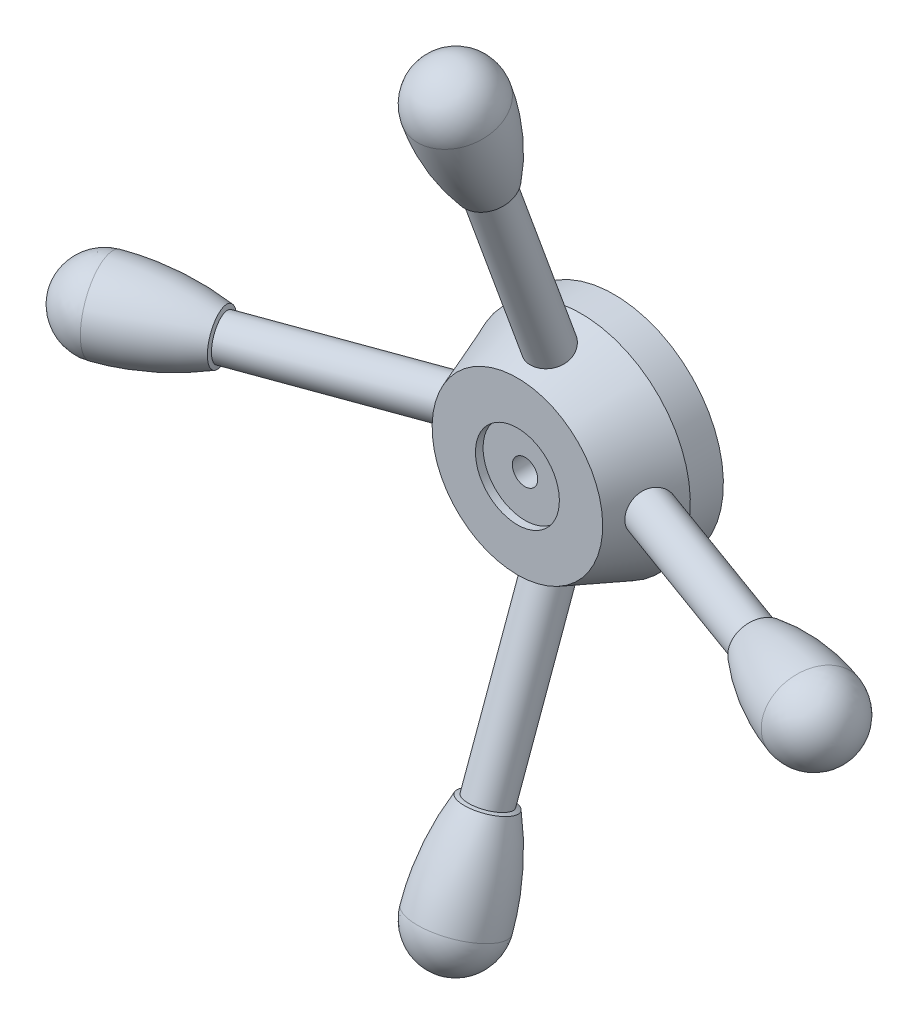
ISO-10303-21;
HEADER;
FILE_DESCRIPTION(('STEP AP214'),'2;1');
FILE_NAME('part.step','',(''),(''),'','','');
FILE_SCHEMA(('AUTOMOTIVE_DESIGN { 1 0 10303 214 1 1 1 1 }'));
ENDSEC;
DATA;
#1=APPLICATION_CONTEXT('core data for automotive mechanical design processes');
#2=APPLICATION_PROTOCOL_DEFINITION('international standard','automotive_design',2000,#1);
#3=PRODUCT_CONTEXT('',#1,'mechanical');
#4=PRODUCT('Part','Part','',(#3));
#5=PRODUCT_RELATED_PRODUCT_CATEGORY('part','',(#4));
#6=PRODUCT_DEFINITION_FORMATION('','',#4);
#7=PRODUCT_DEFINITION_CONTEXT('part definition',#1,'design');
#8=PRODUCT_DEFINITION('design','',#6,#7);
#9=PRODUCT_DEFINITION_SHAPE('','',#8);
#10=(LENGTH_UNIT() NAMED_UNIT(*) SI_UNIT(.MILLI.,.METRE.));
#11=(NAMED_UNIT(*) PLANE_ANGLE_UNIT() SI_UNIT($,.RADIAN.));
#12=(NAMED_UNIT(*) SI_UNIT($,.STERADIAN.) SOLID_ANGLE_UNIT());
#13=UNCERTAINTY_MEASURE_WITH_UNIT(LENGTH_MEASURE(1.E-05),#10,'distance_accuracy_value','');
#14=(GEOMETRIC_REPRESENTATION_CONTEXT(3) GLOBAL_UNCERTAINTY_ASSIGNED_CONTEXT((#13)) GLOBAL_UNIT_ASSIGNED_CONTEXT((#10,
#11,#12)) REPRESENTATION_CONTEXT('',''));
#15=CARTESIAN_POINT('',(0.,0.,0.));
#16=DIRECTION('',(0.,0.,1.));
#17=DIRECTION('',(1.,0.,0.));
#18=AXIS2_PLACEMENT_3D('',#15,#16,#17);
#19=CARTESIAN_POINT('',(0.,0.,16.));
#20=DIRECTION('',(0.,0.,-1.));
#21=DIRECTION('',(0.,1.,0.));
#22=AXIS2_PLACEMENT_3D('',#19,#20,#21);
#23=CONICAL_SURFACE('',#22,43.,0.361861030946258);
#24=CARTESIAN_POINT('',(-5.20461667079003,-40.1239487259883,22.7099339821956));
#25=CARTESIAN_POINT('',(-5.03516976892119,-40.1950198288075,22.5813232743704));
#26=CARTESIAN_POINT('',(-4.85965004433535,-40.263217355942,22.4592228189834));
#27=CARTESIAN_POINT('',(-4.4975133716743,-40.3930926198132,22.228651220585));
#28=CARTESIAN_POINT('',(-4.31089474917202,-40.4547693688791,22.1201821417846));
#29=CARTESIAN_POINT('',(-3.92778454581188,-40.5708302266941,21.9175287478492));
#30=CARTESIAN_POINT('',(-3.73128871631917,-40.6252111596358,21.8233506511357));
#31=CARTESIAN_POINT('',(-3.32976440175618,-40.7259727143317,21.6498809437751));
#32=CARTESIAN_POINT('',(-3.12473293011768,-40.7723505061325,21.5705945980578));
#33=CARTESIAN_POINT('',(-2.707580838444,-40.8564825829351,21.4274389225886));
#34=CARTESIAN_POINT('',(-2.49545855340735,-40.8942348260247,21.3635732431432));
#35=CARTESIAN_POINT('',(-2.0656712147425,-40.9605963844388,21.2517000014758));
#36=CARTESIAN_POINT('',(-1.84800614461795,-40.9892056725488,21.2036924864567));
#37=CARTESIAN_POINT('',(-1.40874654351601,-41.0368862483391,21.1238656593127));
#38=CARTESIAN_POINT('',(-1.18715286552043,-41.0559595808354,21.0920428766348));
#39=CARTESIAN_POINT('',(-0.741599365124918,-41.0843145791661,21.0447862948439));
#40=CARTESIAN_POINT('',(-0.517639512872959,-41.0935961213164,21.0293527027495));
#41=CARTESIAN_POINT('',(-0.0716687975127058,-41.1021869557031,21.0150666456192));
#42=CARTESIAN_POINT('',(0.150333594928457,-41.1016134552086,21.0160192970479));
#43=CARTESIAN_POINT('',(0.593524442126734,-41.090786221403,21.0340268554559));
#44=CARTESIAN_POINT('',(0.814712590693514,-41.0805291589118,21.0510873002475));
#45=CARTESIAN_POINT('',(1.25453338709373,-41.0504745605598,21.1011948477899));
#46=CARTESIAN_POINT('',(1.47316692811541,-41.030680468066,21.1342361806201));
#47=CARTESIAN_POINT('',(1.90649004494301,-40.9818102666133,21.2160992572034));
#48=CARTESIAN_POINT('',(2.12117810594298,-40.9527306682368,21.2649269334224));
#49=CARTESIAN_POINT('',(2.54430260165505,-40.8857915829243,21.3778492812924));
#50=CARTESIAN_POINT('',(2.75275771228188,-40.8479621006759,21.4418917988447));
#51=CARTESIAN_POINT('',(3.16283278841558,-40.7639420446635,21.5849574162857));
#52=CARTESIAN_POINT('',(3.36444965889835,-40.7177477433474,21.6639871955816));
#53=CARTESIAN_POINT('',(3.75940060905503,-40.6175946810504,21.8365260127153));
#54=CARTESIAN_POINT('',(3.95273422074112,-40.5636354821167,21.9300358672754));
#55=CARTESIAN_POINT('',(4.32974084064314,-40.448651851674,22.1309262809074));
#56=CARTESIAN_POINT('',(4.5134179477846,-40.3876304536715,22.2383008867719));
#57=CARTESIAN_POINT('',(4.8726149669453,-40.258303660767,22.4679980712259));
#58=CARTESIAN_POINT('',(5.04797577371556,-40.1899045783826,22.5905167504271));
#59=CARTESIAN_POINT('',(5.38637147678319,-40.0474398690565,22.8484528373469));
#60=CARTESIAN_POINT('',(5.54941072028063,-39.9733762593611,22.983865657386));
#61=CARTESIAN_POINT('',(5.86221428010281,-39.8204130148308,23.2669041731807));
#62=CARTESIAN_POINT('',(6.01197276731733,-39.7415112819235,23.4145351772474));
#63=CARTESIAN_POINT('',(6.29708012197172,-39.5798529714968,23.7210552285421));
#64=CARTESIAN_POINT('',(6.43243383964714,-39.4970977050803,23.8799404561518));
#65=CARTESIAN_POINT('',(6.68952094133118,-39.3275663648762,24.210219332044));
#66=CARTESIAN_POINT('',(6.81105565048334,-39.2407521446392,24.3817481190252));
#67=CARTESIAN_POINT('',(7.03758425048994,-39.0651184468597,24.7344288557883));
#68=CARTESIAN_POINT('',(7.14257836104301,-38.9762989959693,24.9155806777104));
#69=CARTESIAN_POINT('',(7.33525505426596,-38.7976558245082,25.2863969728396));
#70=CARTESIAN_POINT('',(7.4229377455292,-38.7078321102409,25.4760613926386));
#71=CARTESIAN_POINT('',(7.58032137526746,-38.5281711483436,25.8626984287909));
#72=CARTESIAN_POINT('',(7.65002290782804,-38.4383339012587,26.0596708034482));
#73=CARTESIAN_POINT('',(7.77049292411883,-38.2601971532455,26.4583069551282));
#74=CARTESIAN_POINT('',(7.82138436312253,-38.1718913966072,26.6599307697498));
#75=CARTESIAN_POINT('',(7.90445218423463,-37.9971351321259,27.0676957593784));
#76=CARTESIAN_POINT('',(7.93663556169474,-37.9106839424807,27.2738352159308));
#77=CARTESIAN_POINT('',(7.98204179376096,-37.7404241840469,27.6892895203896));
#78=CARTESIAN_POINT('',(7.99526322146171,-37.6566158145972,27.8986046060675));
#79=CARTESIAN_POINT('',(8.00261328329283,-37.4923942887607,28.3188945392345));
#80=CARTESIAN_POINT('',(7.99674217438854,-37.4119810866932,28.5298693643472));
#81=CARTESIAN_POINT('',(7.96621252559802,-37.2565953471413,28.9481586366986));
#82=CARTESIAN_POINT('',(7.94189113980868,-37.1815513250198,29.1554712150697));
#83=CARTESIAN_POINT('',(7.87502518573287,-37.035840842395,29.5687746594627));
#84=CARTESIAN_POINT('',(7.83247428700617,-36.9651759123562,29.7747650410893));
#85=CARTESIAN_POINT('',(7.72948855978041,-36.8286721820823,30.1837604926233));
#86=CARTESIAN_POINT('',(7.66906049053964,-36.7628315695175,30.3867666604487));
#87=CARTESIAN_POINT('',(7.53074528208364,-36.6362004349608,30.7884479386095));
#88=CARTESIAN_POINT('',(7.45285167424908,-36.5754117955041,30.987121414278));
#89=CARTESIAN_POINT('',(7.28041071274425,-36.4592170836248,31.378106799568));
#90=CARTESIAN_POINT('',(7.1859044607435,-36.4037982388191,31.5704330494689));
#91=CARTESIAN_POINT('',(6.98079349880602,-36.2982289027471,31.9478157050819));
#92=CARTESIAN_POINT('',(6.87018823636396,-36.2480785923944,32.1328718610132));
#93=CARTESIAN_POINT('',(6.6336571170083,-36.1530050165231,32.4943506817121));
#94=CARTESIAN_POINT('',(6.50773017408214,-36.1080821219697,32.6707727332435));
#95=CARTESIAN_POINT('',(6.24142999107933,-36.0233454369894,33.0136606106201));
#96=CARTESIAN_POINT('',(6.10105653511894,-35.9835317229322,33.1801262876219));
#97=CARTESIAN_POINT('',(5.80437755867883,-35.9082096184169,33.5045115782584));
#98=CARTESIAN_POINT('',(5.6478472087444,-35.8727831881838,33.6622446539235));
#99=CARTESIAN_POINT('',(5.32190876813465,-35.8067699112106,33.9648911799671));
#100=CARTESIAN_POINT('',(5.15250085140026,-35.7761829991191,34.1098048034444));
#101=CARTESIAN_POINT('',(4.80190615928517,-35.7195596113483,34.3856873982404));
#102=CARTESIAN_POINT('',(4.62071655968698,-35.6935242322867,34.51665300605));
#103=CARTESIAN_POINT('',(4.24788150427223,-35.6457238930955,34.7634766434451));
#104=CARTESIAN_POINT('',(4.05623970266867,-35.623957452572,34.8793399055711));
#105=CARTESIAN_POINT('',(3.66210240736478,-35.5842223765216,35.0959266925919));
#106=CARTESIAN_POINT('',(3.45952976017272,-35.5662869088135,35.1965159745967));
#107=CARTESIAN_POINT('',(3.04643025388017,-35.5341587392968,35.3804838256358));
#108=CARTESIAN_POINT('',(2.8359035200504,-35.5199659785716,35.4638626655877));
#109=CARTESIAN_POINT('',(2.40840190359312,-35.495068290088,35.612633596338));
#110=CARTESIAN_POINT('',(2.19142748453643,-35.4843631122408,35.6780269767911));
#111=CARTESIAN_POINT('',(1.75259148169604,-35.46622799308,35.7902070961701));
#112=CARTESIAN_POINT('',(1.53073006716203,-35.4587979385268,35.8369944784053));
#113=CARTESIAN_POINT('',(1.08685656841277,-35.4471369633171,35.9109879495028));
#114=CARTESIAN_POINT('',(0.864889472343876,-35.4428629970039,35.9384572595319));
#115=CARTESIAN_POINT('',(0.419473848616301,-35.4372553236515,35.9745861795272));
#116=CARTESIAN_POINT('',(0.196025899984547,-35.4359205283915,35.9832527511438));
#117=CARTESIAN_POINT('',(-0.250828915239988,-35.4361586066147,35.9817114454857));
#118=CARTESIAN_POINT('',(-0.474235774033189,-35.4377318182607,35.9715013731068));
#119=CARTESIAN_POINT('',(-0.919354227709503,-35.4438211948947,35.9323025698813));
#120=CARTESIAN_POINT('',(-1.14106583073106,-35.4483373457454,35.9033139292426));
#121=CARTESIAN_POINT('',(-1.57853823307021,-35.4603369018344,35.8273009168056));
#122=CARTESIAN_POINT('',(-1.79433853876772,-35.4677839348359,35.7804978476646));
#123=CARTESIAN_POINT('',(-2.22128979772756,-35.4857974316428,35.6692542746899));
#124=CARTESIAN_POINT('',(-2.43243911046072,-35.4963649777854,35.6048076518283));
#125=CARTESIAN_POINT('',(-2.84850142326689,-35.5208123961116,35.4588899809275));
#126=CARTESIAN_POINT('',(-3.0534162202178,-35.5346913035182,35.3774238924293));
#127=CARTESIAN_POINT('',(-3.45576582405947,-35.5660050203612,35.1981406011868));
#128=CARTESIAN_POINT('',(-3.65319795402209,-35.5834410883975,35.1003176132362));
#129=CARTESIAN_POINT('',(-4.041265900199,-35.6223382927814,34.8880411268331));
#130=CARTESIAN_POINT('',(-4.23180638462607,-35.6438405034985,34.7734208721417));
#131=CARTESIAN_POINT('',(-4.60256233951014,-35.6910348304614,34.5293077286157));
#132=CARTESIAN_POINT('',(-4.78277767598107,-35.7167270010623,34.3998146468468));
#133=CARTESIAN_POINT('',(-5.13172864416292,-35.7725992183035,34.1269752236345));
#134=CARTESIAN_POINT('',(-5.30046141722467,-35.8027803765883,33.9836254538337));
#135=CARTESIAN_POINT('',(-5.62522316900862,-35.8678920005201,33.6842819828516));
#136=CARTESIAN_POINT('',(-5.78125610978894,-35.9028209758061,33.5282922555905));
#137=CARTESIAN_POINT('',(-6.08189878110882,-35.9782500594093,33.202374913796));
#138=CARTESIAN_POINT('',(-6.22629872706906,-36.0188268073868,33.0322714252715));
#139=CARTESIAN_POINT('',(-6.49996241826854,-36.1053381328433,32.6815765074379));
#140=CARTESIAN_POINT('',(-6.62922632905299,-36.1512726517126,32.5009851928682));
#141=CARTESIAN_POINT('',(-6.87168248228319,-36.248631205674,32.130723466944));
#142=CARTESIAN_POINT('',(-6.98487500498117,-36.3000551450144,31.9410532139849));
#143=CARTESIAN_POINT('',(-7.19434510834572,-36.4084339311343,31.5541101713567));
#144=CARTESIAN_POINT('',(-7.29062325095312,-36.4653885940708,31.3568376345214));
#145=CARTESIAN_POINT('',(-7.46497893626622,-36.5843884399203,30.9574855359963));
#146=CARTESIAN_POINT('',(-7.54316793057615,-36.6463990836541,30.755444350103));
#147=CARTESIAN_POINT('',(-7.68149475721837,-36.7756194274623,30.3469830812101));
#148=CARTESIAN_POINT('',(-7.74163929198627,-36.8428271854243,30.1405646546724));
#149=CARTESIAN_POINT('',(-7.84345054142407,-36.9821675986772,29.7248364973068));
#150=CARTESIAN_POINT('',(-7.88511607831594,-37.0543005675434,29.5155265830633));
#151=CARTESIAN_POINT('',(-7.94963994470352,-37.2030650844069,29.0956117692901));
#152=CARTESIAN_POINT('',(-7.97249851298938,-37.2796965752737,28.8850068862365));
#153=CARTESIAN_POINT('',(-7.99901168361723,-37.4355723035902,28.4676693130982));
#154=CARTESIAN_POINT('',(-8.00298768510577,-37.514749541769,28.2609319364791));
#155=CARTESIAN_POINT('',(-7.9925929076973,-37.6763354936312,27.8491104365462));
#156=CARTESIAN_POINT('',(-7.9782161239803,-37.7587452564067,27.6440268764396));
#157=CARTESIAN_POINT('',(-7.93123677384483,-37.9260605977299,27.2369963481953));
#158=CARTESIAN_POINT('',(-7.8986345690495,-38.0109661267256,27.0350493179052));
#159=CARTESIAN_POINT('',(-7.81547285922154,-38.1824912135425,26.6356295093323));
#160=CARTESIAN_POINT('',(-7.76491310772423,-38.2691107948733,26.4381567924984));
#161=CARTESIAN_POINT('',(-7.64614427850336,-38.4433481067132,26.048670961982));
#162=CARTESIAN_POINT('',(-7.57790930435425,-38.5309671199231,25.8566663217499));
#163=CARTESIAN_POINT('',(-7.42436646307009,-38.706158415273,25.4796784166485));
#164=CARTESIAN_POINT('',(-7.3390641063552,-38.7937307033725,25.2946929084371));
#165=CARTESIAN_POINT('',(-7.1520222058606,-38.9679094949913,24.9328568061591));
#166=CARTESIAN_POINT('',(-7.05028933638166,-39.0545163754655,24.756002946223));
#167=CARTESIAN_POINT('',(-6.83111433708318,-39.2258475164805,24.4114319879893));
#168=CARTESIAN_POINT('',(-6.71367440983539,-39.3105720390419,24.2437136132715));
#169=CARTESIAN_POINT('',(-6.3925941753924,-39.5247628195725,23.8255389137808));
#170=CARTESIAN_POINT('',(-6.17796197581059,-39.6522199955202,23.5823820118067));
#171=CARTESIAN_POINT('',(-5.71528877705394,-39.8967355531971,23.1242478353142));
#172=CARTESIAN_POINT('',(-5.46724701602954,-40.0137936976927,22.9092712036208));
#173=CARTESIAN_POINT('',(-5.20461667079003,-40.1239487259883,22.7099339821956));
#174=B_SPLINE_CURVE_WITH_KNOTS('',3,(#24,#25,#26,#27,#28,#29,#30,#31,#32,#33,#34,#35,#36,#37,
#38,#39,#40,#41,#42,#43,#44,#45,#46,#47,#48,#49,#50,#51,#52,#53,#54,#55,#56,#57,#58,#59,#60,#61,
#62,#63,#64,#65,#66,#67,#68,#69,#70,#71,#72,#73,#74,#75,#76,#77,#78,#79,#80,#81,#82,#83,#84,#85,
#86,#87,#88,#89,#90,#91,#92,#93,#94,#95,#96,#97,#98,#99,#100,#101,#102,#103,#104,#105,#106,#107,
#108,#109,#110,#111,#112,#113,#114,#115,#116,#117,#118,#119,#120,#121,#122,#123,#124,#125,#126,
#127,#128,#129,#130,#131,#132,#133,#134,#135,#136,#137,#138,#139,#140,#141,#142,#143,#144,#145,
#146,#147,#148,#149,#150,#151,#152,#153,#154,#155,#156,#157,#158,#159,#160,#161,#162,#163,#164,
#165,#166,#167,#168,#169,#170,#171,#172,#173),.UNSPECIFIED.,.T.,.F.,(4,2,2,2,2,2,2,2,2,2,2,2,2,
2,2,2,2,2,2,2,2,2,2,2,2,2,2,2,2,2,2,2,2,2,2,2,2,2,2,2,2,2,2,2,2,2,2,2,2,2,2,2,2,2,2,2,2,2,2,2,2,
2,2,2,2,2,2,2,2,2,2,2,2,2,4),(0.,0.672565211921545,1.34523214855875,2.01819094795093,
2.69138722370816,3.36474269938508,4.03810017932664,4.71131320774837,5.38453473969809,
6.04975516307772,6.71520437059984,7.38041349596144,8.04587289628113,8.70908330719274,
9.37258999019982,10.0361341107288,10.6993942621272,11.3723800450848,12.0451272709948,
12.7181683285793,13.390982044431,14.0724926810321,14.7539942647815,15.4354915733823,
16.1169663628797,16.7939043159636,17.4705889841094,18.1473245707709,18.8240510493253,
19.4887005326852,20.1535810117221,20.8182104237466,21.4830863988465,22.1463399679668,
22.8096163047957,23.4729396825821,24.1362729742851,24.8105610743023,25.4848400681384,
26.1592812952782,26.8334882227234,27.513314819,28.1931307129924,28.8728978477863,
29.5526414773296,30.2229336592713,30.8929776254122,31.5630995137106,32.2332181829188,
32.8952704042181,33.5575525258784,34.2196419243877,34.8819659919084,35.5513773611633,
36.2207974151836,36.8903835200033,37.5597599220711,38.2393150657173,38.9188627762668,
39.5983986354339,40.2779119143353,40.9531198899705,41.6280767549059,42.3030766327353,
42.9780679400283,43.6415280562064,44.3052053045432,44.9688693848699,45.6325425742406,
46.2971936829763,46.9616305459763,47.6257981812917,48.2898727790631,49.3322760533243,
50.3747031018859),.UNSPECIFIED.);
#175=CARTESIAN_POINT('',(-5.20461667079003,-40.1239487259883,22.7099339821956));
#176=VERTEX_POINT('',#175);
#177=EDGE_CURVE('E27',#176,#176,#174,.T.);
#178=ORIENTED_EDGE('',*,*,#177,.F.);
#179=EDGE_LOOP('',(#178));
#180=FACE_BOUND('',#179,.T.);
#181=CARTESIAN_POINT('',(40.556704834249,5.3394046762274,21.5301733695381));
#182=CARTESIAN_POINT('',(40.4836805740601,5.5071618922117,21.6635939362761));
#183=CARTESIAN_POINT('',(40.40788440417,5.6684953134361,21.803487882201));
#184=CARTESIAN_POINT('',(40.2516139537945,5.97734896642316,22.0954888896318));
#185=CARTESIAN_POINT('',(40.1711388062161,6.12486662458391,22.2475982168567));
#186=CARTESIAN_POINT('',(40.0064352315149,6.40509835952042,22.5631891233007));
#187=CARTESIAN_POINT('',(39.9222045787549,6.53780349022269,22.7266774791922));
#188=CARTESIAN_POINT('',(39.7509783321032,6.78743379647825,23.064042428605));
#189=CARTESIAN_POINT('',(39.663981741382,6.90435320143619,23.2379227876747));
#190=CARTESIAN_POINT('',(39.4882680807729,7.12148405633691,23.5949172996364));
#191=CARTESIAN_POINT('',(39.3995515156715,7.22170032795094,23.7780287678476));
#192=CARTESIAN_POINT('',(39.2213183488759,7.40476857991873,24.1524882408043));
#193=CARTESIAN_POINT('',(39.131801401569,7.48761263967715,24.3438399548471));
#194=CARTESIAN_POINT('',(38.9529989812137,7.63522668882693,24.7334362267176));
#195=CARTESIAN_POINT('',(38.8637134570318,7.7000010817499,24.9316790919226));
#196=CARTESIAN_POINT('',(38.6863291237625,7.81096110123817,25.333701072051));
#197=CARTESIAN_POINT('',(38.5982297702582,7.85715555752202,25.5374775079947));
#198=CARTESIAN_POINT('',(38.424873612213,7.93027225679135,25.9473360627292));
#199=CARTESIAN_POINT('',(38.339597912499,7.95737095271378,26.1533787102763));
#200=CARTESIAN_POINT('',(38.1718566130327,7.99275336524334,26.5681165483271));
#201=CARTESIAN_POINT('',(38.0893899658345,8.00104417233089,26.7768107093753));
#202=CARTESIAN_POINT('',(37.9279284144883,7.99874569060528,27.1954661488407));
#203=CARTESIAN_POINT('',(37.8489339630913,7.98815394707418,27.4054275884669));
#204=CARTESIAN_POINT('',(37.6950350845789,7.94815316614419,27.8250555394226));
#205=CARTESIAN_POINT('',(37.6201306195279,7.91874430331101,28.03472205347));
#206=CARTESIAN_POINT('',(37.4760058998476,7.84191781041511,28.4490403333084));
#207=CARTESIAN_POINT('',(37.4067168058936,7.79477929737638,28.6537199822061));
#208=CARTESIAN_POINT('',(37.2729230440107,7.68279977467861,29.0598573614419));
#209=CARTESIAN_POINT('',(37.2084200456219,7.61795262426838,29.2613139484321));
#210=CARTESIAN_POINT('',(37.0844940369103,7.47107254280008,29.6593839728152));
#211=CARTESIAN_POINT('',(37.0250693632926,7.38904526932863,29.8559989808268));
#212=CARTESIAN_POINT('',(36.9113939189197,7.20836471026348,30.2430740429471));
#213=CARTESIAN_POINT('',(36.8571449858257,7.10970555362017,30.4335318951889));
#214=CARTESIAN_POINT('',(36.7536280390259,6.89597157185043,30.8077261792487));
#215=CARTESIAN_POINT('',(36.7043856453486,6.78081892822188,30.9914252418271));
#216=CARTESIAN_POINT('',(36.6111286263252,6.53527913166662,31.3497452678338));
#217=CARTESIAN_POINT('',(36.5671140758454,6.40489176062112,31.5243661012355));
#218=CARTESIAN_POINT('',(36.4841688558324,6.12975103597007,31.8632593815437));
#219=CARTESIAN_POINT('',(36.4452394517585,5.98499412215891,32.0275292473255));
#220=CARTESIAN_POINT('',(36.3722926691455,5.68216817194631,32.3443790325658));
#221=CARTESIAN_POINT('',(36.338273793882,5.52410321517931,32.496962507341));
#222=CARTESIAN_POINT('',(36.2743543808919,5.19288009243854,32.7918078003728));
#223=CARTESIAN_POINT('',(36.2445336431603,5.01951110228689,32.9338501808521));
#224=CARTESIAN_POINT('',(36.1894274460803,4.66123567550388,33.2035297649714));
#225=CARTESIAN_POINT('',(36.1641419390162,4.47632936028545,33.3311671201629));
#226=CARTESIAN_POINT('',(36.1178107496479,4.09623111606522,33.5709744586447));
#227=CARTESIAN_POINT('',(36.096765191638,3.90103888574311,33.683143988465));
#228=CARTESIAN_POINT('',(36.0586258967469,3.50172003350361,33.8910380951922));
#229=CARTESIAN_POINT('',(36.0415320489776,3.29759366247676,33.9867631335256));
#230=CARTESIAN_POINT('',(36.0110129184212,2.88164823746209,34.1609885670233));
#231=CARTESIAN_POINT('',(35.997590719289,2.66982288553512,34.2394744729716));
#232=CARTESIAN_POINT('',(35.9742012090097,2.24022382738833,34.3783665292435));
#233=CARTESIAN_POINT('',(35.9642326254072,2.02245234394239,34.4387793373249));
#234=CARTESIAN_POINT('',(35.9475510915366,1.58244164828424,34.5409918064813));
#235=CARTESIAN_POINT('',(35.9408384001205,1.36020208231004,34.5827899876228));
#236=CARTESIAN_POINT('',(35.9305323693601,0.912904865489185,34.6473570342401));
#237=CARTESIAN_POINT('',(35.9269389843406,0.687847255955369,34.6701261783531));
#238=CARTESIAN_POINT('',(35.9228297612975,0.240377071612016,34.6961895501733));
#239=CARTESIAN_POINT('',(35.9222632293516,0.0179835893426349,34.6998045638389));
#240=CARTESIAN_POINT('',(35.9240599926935,-0.4263906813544,34.6883859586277));
#241=CARTESIAN_POINT('',(35.9264243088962,-0.648371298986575,34.6733458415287));
#242=CARTESIAN_POINT('',(35.9341321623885,-1.09015708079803,34.6247602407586));
#243=CARTESIAN_POINT('',(35.9394745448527,-1.30996305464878,34.5912219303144));
#244=CARTESIAN_POINT('',(35.9532480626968,-1.7460011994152,34.5059482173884));
#245=CARTESIAN_POINT('',(35.9616803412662,-1.96223201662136,34.4542060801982));
#246=CARTESIAN_POINT('',(35.9817426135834,-2.38840285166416,34.3333254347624));
#247=CARTESIAN_POINT('',(35.9933557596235,-2.59836972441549,34.2642787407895));
#248=CARTESIAN_POINT('',(36.0200031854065,-3.01174776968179,34.109275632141));
#249=CARTESIAN_POINT('',(36.0350375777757,-3.21515872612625,34.0233186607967));
#250=CARTESIAN_POINT('',(36.0687683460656,-3.61406209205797,33.835239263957));
#251=CARTESIAN_POINT('',(36.0874649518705,-3.80955400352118,33.7331158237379));
#252=CARTESIAN_POINT('',(36.1287840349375,-4.19131335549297,33.5135669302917));
#253=CARTESIAN_POINT('',(36.1514065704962,-4.37758065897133,33.3961412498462));
#254=CARTESIAN_POINT('',(36.2012307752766,-4.74243311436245,33.1450425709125));
#255=CARTESIAN_POINT('',(36.2284970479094,-4.92085768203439,33.0111490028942));
#256=CARTESIAN_POINT('',(36.2876452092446,-5.26573488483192,32.7296701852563));
#257=CARTESIAN_POINT('',(36.3195270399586,-5.4321876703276,32.5820851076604));
#258=CARTESIAN_POINT('',(36.388180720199,-5.7520394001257,32.2743563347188));
#259=CARTESIAN_POINT('',(36.4249537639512,-5.90543514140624,32.114209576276));
#260=CARTESIAN_POINT('',(36.503598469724,-6.19802566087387,31.7826960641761));
#261=CARTESIAN_POINT('',(36.5454683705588,-6.33722531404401,31.6113331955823));
#262=CARTESIAN_POINT('',(36.6349189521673,-6.60178118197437,31.2569564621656));
#263=CARTESIAN_POINT('',(36.6825507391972,-6.72699119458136,31.0738462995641));
#264=CARTESIAN_POINT('',(36.7832998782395,-6.96109057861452,30.6989115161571));
#265=CARTESIAN_POINT('',(36.8364171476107,-7.06998019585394,30.507087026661));
#266=CARTESIAN_POINT('',(36.9481438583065,-7.27061966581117,30.1162218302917));
#267=CARTESIAN_POINT('',(37.0067529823,-7.36237050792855,29.9171815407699));
#268=CARTESIAN_POINT('',(37.1293655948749,-7.52803258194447,29.5134244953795));
#269=CARTESIAN_POINT('',(37.1933688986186,-7.60194442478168,29.3087079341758));
#270=CARTESIAN_POINT('',(37.3257292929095,-7.73055286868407,28.8977381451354));
#271=CARTESIAN_POINT('',(37.3940227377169,-7.7854758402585,28.6915352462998));
#272=CARTESIAN_POINT('',(37.5353059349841,-7.87692113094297,28.2767598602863));
#273=CARTESIAN_POINT('',(37.6082939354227,-7.91345027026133,28.0681882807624));
#274=CARTESIAN_POINT('',(37.7585502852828,-7.96786327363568,27.6501302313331));
#275=CARTESIAN_POINT('',(37.8358191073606,-7.9857450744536,27.440643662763));
#276=CARTESIAN_POINT('',(37.9940695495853,-8.00272931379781,27.0223138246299));
#277=CARTESIAN_POINT('',(38.0750511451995,-8.00183187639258,26.8134705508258));
#278=CARTESIAN_POINT('',(38.2389665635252,-7.98142087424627,26.4006866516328));
#279=CARTESIAN_POINT('',(38.3218601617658,-7.96215476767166,26.1967177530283));
#280=CARTESIAN_POINT('',(38.4899229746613,-7.90552231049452,25.7921766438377));
#281=CARTESIAN_POINT('',(38.5750929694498,-7.86814967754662,25.5916056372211));
#282=CARTESIAN_POINT('',(38.7468604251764,-7.77561699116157,25.1953161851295));
#283=CARTESIAN_POINT('',(38.8334574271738,-7.72046255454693,24.9995962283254));
#284=CARTESIAN_POINT('',(39.0072899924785,-7.59276466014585,24.6141183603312));
#285=CARTESIAN_POINT('',(39.0945257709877,-7.52021505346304,24.4243625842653));
#286=CARTESIAN_POINT('',(39.2694007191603,-7.35764188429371,24.0505986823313));
#287=CARTESIAN_POINT('',(39.3570377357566,-7.26748657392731,23.8666468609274));
#288=CARTESIAN_POINT('',(39.5311043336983,-7.07072171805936,23.5071640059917));
#289=CARTESIAN_POINT('',(39.6175338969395,-6.96411192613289,23.3316330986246));
#290=CARTESIAN_POINT('',(39.78826780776,-6.73515855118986,22.9899844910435));
#291=CARTESIAN_POINT('',(39.8725716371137,-6.61281117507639,22.8238690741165));
#292=CARTESIAN_POINT('',(40.0380723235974,-6.35327877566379,22.5021050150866));
#293=CARTESIAN_POINT('',(40.1192701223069,-6.21609829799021,22.34645318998));
#294=CARTESIAN_POINT('',(40.2790259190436,-5.92531462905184,22.0438763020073));
#295=CARTESIAN_POINT('',(40.3575149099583,-5.77147045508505,21.8971463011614));
#296=CARTESIAN_POINT('',(40.5094192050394,-5.45040136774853,21.6162408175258));
#297=CARTESIAN_POINT('',(40.5828345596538,-5.28317658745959,21.4820652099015));
#298=CARTESIAN_POINT('',(40.7237001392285,-4.93647363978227,21.2270568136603));
#299=CARTESIAN_POINT('',(40.791150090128,-4.75699491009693,21.1062246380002));
#300=CARTESIAN_POINT('',(40.9192368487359,-4.38702092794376,20.8786430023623));
#301=CARTESIAN_POINT('',(40.9798738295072,-4.19652595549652,20.7718931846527));
#302=CARTESIAN_POINT('',(41.0936735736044,-3.8054423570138,20.5729357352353));
#303=CARTESIAN_POINT('',(41.146821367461,-3.60483457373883,20.4807571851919));
#304=CARTESIAN_POINT('',(41.2447846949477,-3.19535424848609,20.3118139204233));
#305=CARTESIAN_POINT('',(41.2896032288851,-2.98648471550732,20.2350436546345));
#306=CARTESIAN_POINT('',(41.3703336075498,-2.56188580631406,20.0973716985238));
#307=CARTESIAN_POINT('',(41.406244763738,-2.34615590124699,20.0364712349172));
#308=CARTESIAN_POINT('',(41.4686641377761,-1.90941788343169,19.9309557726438));
#309=CARTESIAN_POINT('',(41.4951724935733,-1.68840984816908,19.8863405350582));
#310=CARTESIAN_POINT('',(41.5380924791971,-1.24610286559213,19.8142478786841));
#311=CARTESIAN_POINT('',(41.5546502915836,-1.02485852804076,19.7865222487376));
#312=CARTESIAN_POINT('',(41.5780623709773,-0.580423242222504,19.7473511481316));
#313=CARTESIAN_POINT('',(41.5849166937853,-0.357232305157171,19.7359055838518));
#314=CARTESIAN_POINT('',(41.5888279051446,0.089496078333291,19.7293722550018));
#315=CARTESIAN_POINT('',(41.5858838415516,0.313033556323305,19.7342860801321));
#316=CARTESIAN_POINT('',(41.5702367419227,0.758804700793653,19.7604413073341));
#317=CARTESIAN_POINT('',(41.5575338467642,0.981038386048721,19.7816824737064));
#318=CARTESIAN_POINT('',(41.5227249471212,1.42030070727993,19.8400431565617));
#319=CARTESIAN_POINT('',(41.5007179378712,1.63735942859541,19.8769955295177));
#320=CARTESIAN_POINT('',(41.4476102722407,2.0670978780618,19.9665051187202));
#321=CARTESIAN_POINT('',(41.4165096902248,2.27977764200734,20.0190622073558));
#322=CARTESIAN_POINT('',(41.3456427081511,2.69915281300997,20.1394078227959));
#323=CARTESIAN_POINT('',(41.3058820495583,2.90585208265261,20.2071862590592));
#324=CARTESIAN_POINT('',(41.2182113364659,3.31194310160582,20.3575398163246));
#325=CARTESIAN_POINT('',(41.1703025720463,3.51133600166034,20.4401125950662));
#326=CARTESIAN_POINT('',(41.0405745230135,4.00095739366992,20.6653116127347));
#327=CARTESIAN_POINT('',(40.9539080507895,4.28575461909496,20.817110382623));
#328=CARTESIAN_POINT('',(40.7657326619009,4.83147855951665,21.1513188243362));
#329=CARTESIAN_POINT('',(40.6642233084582,5.09240457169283,21.3337293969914));
#330=CARTESIAN_POINT('',(40.556704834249,5.3394046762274,21.5301733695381));
#331=B_SPLINE_CURVE_WITH_KNOTS('',3,(#181,#182,#183,#184,#185,#186,#187,#188,#189,#190,#191,
#192,#193,#194,#195,#196,#197,#198,#199,#200,#201,#202,#203,#204,#205,#206,#207,#208,#209,#210,
#211,#212,#213,#214,#215,#216,#217,#218,#219,#220,#221,#222,#223,#224,#225,#226,#227,#228,#229,
#230,#231,#232,#233,#234,#235,#236,#237,#238,#239,#240,#241,#242,#243,#244,#245,#246,#247,#248,
#249,#250,#251,#252,#253,#254,#255,#256,#257,#258,#259,#260,#261,#262,#263,#264,#265,#266,#267,
#268,#269,#270,#271,#272,#273,#274,#275,#276,#277,#278,#279,#280,#281,#282,#283,#284,#285,#286,
#287,#288,#289,#290,#291,#292,#293,#294,#295,#296,#297,#298,#299,#300,#301,#302,#303,#304,#305,
#306,#307,#308,#309,#310,#311,#312,#313,#314,#315,#316,#317,#318,#319,#320,#321,#322,#323,#324,
#325,#326,#327,#328,#329,#330),.UNSPECIFIED.,.T.,.F.,(4,2,2,2,2,2,2,2,2,2,2,2,2,2,2,2,2,2,2,2,2,
2,2,2,2,2,2,2,2,2,2,2,2,2,2,2,2,2,2,2,2,2,2,2,2,2,2,2,2,2,2,2,2,2,2,2,2,2,2,2,2,2,2,2,2,2,2,2,2,
2,2,2,2,2,4),(0.,0.679039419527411,1.35820508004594,2.03777873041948,2.71760013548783,
3.3972249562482,4.07715897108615,4.7569271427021,5.43637188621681,6.10945288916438,
6.78228010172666,7.45519478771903,8.12810323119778,8.79083369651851,9.45379426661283,
10.1165368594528,10.77951389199,11.4457288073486,12.1119532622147,12.7783431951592,
13.444529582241,14.1220356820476,14.7995346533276,15.4770534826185,16.1545532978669,
16.832620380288,17.5104373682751,18.1883082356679,18.8661691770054,19.5326408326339,
20.1993447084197,20.865790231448,21.532482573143,22.1957098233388,22.858958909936,
23.5222496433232,24.1855502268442,24.8589717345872,25.5323847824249,26.2059625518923,
26.8793082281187,27.5591374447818,28.2389564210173,28.9187361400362,29.5984925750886,
30.2698409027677,30.9409401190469,31.6121135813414,32.283282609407,32.9455357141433,
33.6080187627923,34.2702927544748,34.932801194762,35.6004717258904,36.2681522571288,
36.9359940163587,37.6036316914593,38.2827011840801,38.9617639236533,39.6408578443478,
40.3199345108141,41.0003498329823,41.6805195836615,42.3607418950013,43.0409542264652,
43.7109124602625,44.3808668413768,45.05088632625,45.7208961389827,46.3839497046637,
47.0469978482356,47.7096077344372,48.3721128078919,49.3718782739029,50.3716731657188),.UNSPECIFIED.);
#332=CARTESIAN_POINT('',(40.556704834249,5.3394046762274,21.5301733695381));
#333=VERTEX_POINT('',#332);
#334=EDGE_CURVE('E114',#333,#333,#331,.T.);
#335=ORIENTED_EDGE('',*,*,#334,.F.);
#336=EDGE_LOOP('',(#335));
#337=FACE_BOUND('',#336,.T.);
#338=CARTESIAN_POINT('',(0.,0.,41.));
#339=DIRECTION('',(0.,0.,1.));
#340=DIRECTION('',(0.,-1.,0.));
#341=AXIS2_PLACEMENT_3D('',#338,#339,#340);
#342=CIRCLE('',#341,33.5367739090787);
#343=CARTESIAN_POINT('',(0.,-33.5367739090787,41.));
#344=VERTEX_POINT('',#343);
#345=EDGE_CURVE('E102',#344,#344,#342,.T.);
#346=ORIENTED_EDGE('',*,*,#345,.F.);
#347=EDGE_LOOP('',(#346));
#348=FACE_BOUND('',#347,.T.);
#349=CARTESIAN_POINT('',(0.,0.,16.));
#350=DIRECTION('',(0.,0.,1.));
#351=DIRECTION('',(0.,-1.,0.));
#352=AXIS2_PLACEMENT_3D('',#349,#350,#351);
#353=CIRCLE('',#352,43.);
#354=CARTESIAN_POINT('',(0.,-43.,16.));
#355=VERTEX_POINT('',#354);
#356=EDGE_CURVE('E105',#355,#355,#353,.T.);
#357=ORIENTED_EDGE('',*,*,#356,.T.);
#358=EDGE_LOOP('',(#357));
#359=FACE_BOUND('',#358,.T.);
#360=CARTESIAN_POINT('',(-40.556704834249,5.33940467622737,21.5301733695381));
#361=CARTESIAN_POINT('',(-40.6291147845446,5.1730693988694,21.3978754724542));
#362=CARTESIAN_POINT('',(-40.6987656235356,5.00049541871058,21.2720039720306));
#363=CARTESIAN_POINT('',(-40.8317641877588,4.64390502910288,21.0337433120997));
#364=CARTESIAN_POINT('',(-40.8951109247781,4.4598868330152,20.9213562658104));
#365=CARTESIAN_POINT('',(-41.0147147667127,4.08161105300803,20.7107390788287));
#366=CARTESIAN_POINT('',(-41.0709686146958,3.88734882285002,20.6125154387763));
#367=CARTESIAN_POINT('',(-41.1756582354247,3.48991233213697,20.4308527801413));
#368=CARTESIAN_POINT('',(-41.2240912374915,3.28673494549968,20.3474190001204));
#369=CARTESIAN_POINT('',(-41.3124920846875,2.87290046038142,20.1958927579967));
#370=CARTESIAN_POINT('',(-41.3524581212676,2.66224177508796,20.1278035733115));
#371=CARTESIAN_POINT('',(-41.42338023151,2.2349725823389,20.007431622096));
#372=CARTESIAN_POINT('',(-41.454336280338,2.01836205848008,19.9551488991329));
#373=CARTESIAN_POINT('',(-41.5068129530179,1.58079316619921,19.8667483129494));
#374=CARTESIAN_POINT('',(-41.5283356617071,1.35983576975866,19.830626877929));
#375=CARTESIAN_POINT('',(-41.5616603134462,0.915128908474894,19.7747766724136));
#376=CARTESIAN_POINT('',(-41.5734621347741,0.691379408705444,19.7550481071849));
#377=CARTESIAN_POINT('',(-41.5871000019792,0.245391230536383,19.732255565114));
#378=CARTESIAN_POINT('',(-41.5890523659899,0.0231660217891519,19.728997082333));
#379=CARTESIAN_POINT('',(-41.5832779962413,-0.420884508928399,19.738643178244));
#380=CARTESIAN_POINT('',(-41.5755479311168,-0.642709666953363,19.7515533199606));
#381=CARTESIAN_POINT('',(-41.5505124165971,-1.08420816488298,19.793451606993));
#382=CARTESIAN_POINT('',(-41.5332104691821,-1.30388226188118,19.822433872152));
#383=CARTESIAN_POINT('',(-41.4892582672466,-1.73967772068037,19.8962931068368));
#384=CARTESIAN_POINT('',(-41.4626045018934,-1.95579771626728,19.9411760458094));
#385=CARTESIAN_POINT('',(-41.4004475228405,-2.38189888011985,20.0462989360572));
#386=CARTESIAN_POINT('',(-41.3649853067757,-2.59190358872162,20.1064677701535));
#387=CARTESIAN_POINT('',(-41.2855939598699,-3.00544468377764,20.2419083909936));
#388=CARTESIAN_POINT('',(-41.241661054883,-3.20897813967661,20.3171869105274));
#389=CARTESIAN_POINT('',(-41.1458965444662,-3.60810831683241,20.4823665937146));
#390=CARTESIAN_POINT('',(-41.0940645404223,-3.80370463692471,20.5722684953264));
#391=CARTESIAN_POINT('',(-40.9831750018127,-4.1855619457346,20.7661059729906));
#392=CARTESIAN_POINT('',(-40.9241205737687,-4.37182689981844,20.8700355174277));
#393=CARTESIAN_POINT('',(-40.7986360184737,-4.73636444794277,21.0928601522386));
#394=CARTESIAN_POINT('',(-40.7321160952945,-4.91449296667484,21.2119404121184));
#395=CARTESIAN_POINT('',(-40.5932134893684,-5.25873825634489,21.463172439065));
#396=CARTESIAN_POINT('',(-40.5208328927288,-5.42485926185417,21.5953195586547));
#397=CARTESIAN_POINT('',(-40.3710215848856,-5.7441231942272,21.8720126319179));
#398=CARTESIAN_POINT('',(-40.2935886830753,-5.8972604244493,22.0165639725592));
#399=CARTESIAN_POINT('',(-40.1346357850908,-6.18940059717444,22.3171295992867));
#400=CARTESIAN_POINT('',(-40.0531171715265,-6.32840827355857,22.4731400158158));
#401=CARTESIAN_POINT('',(-39.8857855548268,-6.59317600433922,22.7979366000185));
#402=CARTESIAN_POINT('',(-39.7999295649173,-6.71873294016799,22.9668662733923));
#403=CARTESIAN_POINT('',(-39.6259472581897,-6.95353100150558,23.3146036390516));
#404=CARTESIAN_POINT('',(-39.5378209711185,-7.06277234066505,23.4934112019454));
#405=CARTESIAN_POINT('',(-39.3602916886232,-7.26414570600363,23.8598148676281));
#406=CARTESIAN_POINT('',(-39.270888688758,-7.35627767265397,24.0474110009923));
#407=CARTESIAN_POINT('',(-39.0917948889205,-7.52273468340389,24.4302067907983));
#408=CARTESIAN_POINT('',(-39.0021040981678,-7.59706029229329,24.6254062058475));
#409=CARTESIAN_POINT('',(-38.8238579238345,-7.7269877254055,25.0211130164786));
#410=CARTESIAN_POINT('',(-38.7352990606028,-7.78268497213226,25.2215875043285));
#411=CARTESIAN_POINT('',(-38.5597807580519,-7.87541960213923,25.6274016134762));
#412=CARTESIAN_POINT('',(-38.4728207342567,-7.91246394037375,25.8327393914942));
#413=CARTESIAN_POINT('',(-38.3013031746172,-7.96761305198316,26.2469523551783));
#414=CARTESIAN_POINT('',(-38.2167458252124,-7.98571635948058,26.4558278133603));
#415=CARTESIAN_POINT('',(-38.0508074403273,-8.00281199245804,26.8756119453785));
#416=CARTESIAN_POINT('',(-37.9694263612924,-8.00180458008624,27.0865205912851));
#417=CARTESIAN_POINT('',(-37.8119050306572,-7.98085450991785,27.5051252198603));
#418=CARTESIAN_POINT('',(-37.7356979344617,-7.96124394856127,27.7128127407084));
#419=CARTESIAN_POINT('',(-37.5875059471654,-7.90369555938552,28.1272360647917));
#420=CARTESIAN_POINT('',(-37.5155225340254,-7.86575135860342,28.3339715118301));
#421=CARTESIAN_POINT('',(-37.37624746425,-7.77182768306,28.7448572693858));
#422=CARTESIAN_POINT('',(-37.3089548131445,-7.71585204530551,28.9490081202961));
#423=CARTESIAN_POINT('',(-37.179352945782,-7.58628508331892,29.3532656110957));
#424=CARTESIAN_POINT('',(-37.1170438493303,-7.51269333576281,29.5533721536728));
#425=CARTESIAN_POINT('',(-36.9978252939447,-7.34874699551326,29.9473284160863));
#426=CARTESIAN_POINT('',(-36.9408969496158,-7.25845459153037,30.1411983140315));
#427=CARTESIAN_POINT('',(-36.8322694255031,-7.06158881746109,30.522015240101));
#428=CARTESIAN_POINT('',(-36.7805703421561,-6.95501514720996,30.7089621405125));
#429=CARTESIAN_POINT('',(-36.6823962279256,-6.72635733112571,31.0745317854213));
#430=CARTESIAN_POINT('',(-36.6359207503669,-6.60427451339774,31.2531552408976));
#431=CARTESIAN_POINT('',(-36.5480796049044,-6.34539673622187,31.6008281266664));
#432=CARTESIAN_POINT('',(-36.5067156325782,-6.20859692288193,31.7698743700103));
#433=CARTESIAN_POINT('',(-36.4283531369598,-5.91903346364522,32.0995849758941));
#434=CARTESIAN_POINT('',(-36.3914315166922,-5.76605669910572,32.260080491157));
#435=CARTESIAN_POINT('',(-36.3224790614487,-5.4469714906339,32.5685832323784));
#436=CARTESIAN_POINT('',(-36.2904482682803,-5.28086293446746,32.7165903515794));
#437=CARTESIAN_POINT('',(-36.2310060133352,-4.93659864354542,32.9989716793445));
#438=CARTESIAN_POINT('',(-36.2035955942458,-4.7584402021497,33.1333428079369));
#439=CARTESIAN_POINT('',(-36.153125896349,-4.39136972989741,33.3872766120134));
#440=CARTESIAN_POINT('',(-36.1300652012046,-4.20246122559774,33.5068441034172));
#441=CARTESIAN_POINT('',(-36.0877968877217,-3.81328738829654,33.7312701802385));
#442=CARTESIAN_POINT('',(-36.0686275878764,-3.61293188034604,33.8359796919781));
#443=CARTESIAN_POINT('',(-36.0341326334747,-3.20390589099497,34.0284103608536));
#444=CARTESIAN_POINT('',(-36.0188069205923,-2.99523553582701,34.1161317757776));
#445=CARTESIAN_POINT('',(-35.991741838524,-2.57106476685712,34.273780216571));
#446=CARTESIAN_POINT('',(-35.9800022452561,-2.35556478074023,34.3437083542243));
#447=CARTESIAN_POINT('',(-35.9598905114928,-1.9192799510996,34.4651139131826));
#448=CARTESIAN_POINT('',(-35.9515182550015,-1.69849528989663,34.5165919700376));
#449=CARTESIAN_POINT('',(-35.9380582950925,-1.25604976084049,34.6000727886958));
#450=CARTESIAN_POINT('',(-35.9329306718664,-1.03443469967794,34.6323119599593));
#451=CARTESIAN_POINT('',(-35.9256910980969,-0.58930813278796,34.6779961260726));
#452=CARTESIAN_POINT('',(-35.9235780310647,-0.365797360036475,34.6914480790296));
#453=CARTESIAN_POINT('',(-35.9223193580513,0.0815953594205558,34.6994489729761));
#454=CARTESIAN_POINT('',(-35.9231740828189,0.305477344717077,34.6939958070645));
#455=CARTESIAN_POINT('',(-35.9278698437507,0.751951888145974,34.6642351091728));
#456=CARTESIAN_POINT('',(-35.9317108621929,0.974544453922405,34.6399276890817));
#457=CARTESIAN_POINT('',(-35.9423904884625,1.41399592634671,34.5731252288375));
#458=CARTESIAN_POINT('',(-35.9491901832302,1.63089175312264,34.5308664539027));
#459=CARTESIAN_POINT('',(-35.9659134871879,2.06040796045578,34.4285803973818));
#460=CARTESIAN_POINT('',(-35.9758381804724,2.27302683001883,34.3685469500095));
#461=CARTESIAN_POINT('',(-35.9989889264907,2.69238139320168,34.2312842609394));
#462=CARTESIAN_POINT('',(-36.0122139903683,2.89911882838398,34.1540601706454));
#463=CARTESIAN_POINT('',(-36.0421943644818,3.30544880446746,33.9830584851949));
#464=CARTESIAN_POINT('',(-36.0589509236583,3.50503878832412,33.8892750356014));
#465=CARTESIAN_POINT('',(-36.0964153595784,3.8974607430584,33.6850422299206));
#466=CARTESIAN_POINT('',(-36.1171580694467,4.09021393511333,33.5744478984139));
#467=CARTESIAN_POINT('',(-36.1627718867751,4.46572339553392,33.3381673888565));
#468=CARTESIAN_POINT('',(-36.1876430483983,4.64847953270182,33.2124810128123));
#469=CARTESIAN_POINT('',(-36.2418034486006,5.00282320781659,32.9470100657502));
#470=CARTESIAN_POINT('',(-36.2710937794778,5.17440796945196,32.8072220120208));
#471=CARTESIAN_POINT('',(-36.3343502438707,5.50516667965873,32.5147302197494));
#472=CARTESIAN_POINT('',(-36.3683149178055,5.66434447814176,32.3620305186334));
#473=CARTESIAN_POINT('',(-36.4417365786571,5.97164571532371,32.0424040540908));
#474=CARTESIAN_POINT('',(-36.4812704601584,6.11955984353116,31.875293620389));
#475=CARTESIAN_POINT('',(-36.5656282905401,6.40051073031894,31.5302543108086));
#476=CARTESIAN_POINT('',(-36.6104521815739,6.53354765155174,31.3523255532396));
#477=CARTESIAN_POINT('',(-36.7055330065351,6.78379005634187,30.9870356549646));
#478=CARTESIAN_POINT('',(-36.7557899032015,6.90099564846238,30.7996745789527));
#479=CARTESIAN_POINT('',(-36.8617939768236,7.11870823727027,30.4169786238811));
#480=CARTESIAN_POINT('',(-36.9175409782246,7.21921576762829,30.221643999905));
#481=CARTESIAN_POINT('',(-37.0342074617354,7.40234045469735,29.825450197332));
#482=CARTESIAN_POINT('',(-37.0951011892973,7.48504010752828,29.6246215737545));
#483=CARTESIAN_POINT('',(-37.2221108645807,7.63248762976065,29.2181736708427));
#484=CARTESIAN_POINT('',(-37.2882248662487,7.69724214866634,29.0125561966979));
#485=CARTESIAN_POINT('',(-37.425427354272,7.80833977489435,28.5980164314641));
#486=CARTESIAN_POINT('',(-37.4965161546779,7.85468171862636,28.3890939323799));
#487=CARTESIAN_POINT('',(-37.6432701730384,7.9285871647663,27.969542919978));
#488=CARTESIAN_POINT('',(-37.7189353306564,7.95615091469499,27.7589144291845));
#489=CARTESIAN_POINT('',(-37.8730117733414,7.99198684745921,27.3410982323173));
#490=CARTESIAN_POINT('',(-37.9513548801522,8.00057773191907,27.1339126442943));
#491=CARTESIAN_POINT('',(-38.1114005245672,7.99936178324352,26.7208191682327));
#492=CARTESIAN_POINT('',(-38.193104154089,7.98954892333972,26.5149117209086));
#493=CARTESIAN_POINT('',(-38.3591573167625,7.95160905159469,26.1058775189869));
#494=CARTESIAN_POINT('',(-38.4435067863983,7.92348247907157,25.9027506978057));
#495=CARTESIAN_POINT('',(-38.6140888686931,7.84915041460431,25.5006373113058));
#496=CARTESIAN_POINT('',(-38.7003215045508,7.8029446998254,25.3016507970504));
#497=CARTESIAN_POINT('',(-38.8738402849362,7.69281986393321,24.9091165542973));
#498=CARTESIAN_POINT('',(-38.9611264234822,7.62890084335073,24.7155687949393));
#499=CARTESIAN_POINT('',(-39.1358488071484,7.4838595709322,24.3351908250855));
#500=CARTESIAN_POINT('',(-39.2232849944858,7.40274289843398,24.1483584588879));
#501=CARTESIAN_POINT('',(-39.3973985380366,7.22391738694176,23.7825500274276));
#502=CARTESIAN_POINT('',(-39.4840761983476,7.12621555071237,23.603570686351));
#503=CARTESIAN_POINT('',(-39.6557651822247,6.91492376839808,23.2544888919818));
#504=CARTESIAN_POINT('',(-39.740776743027,6.80133610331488,23.0843851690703));
#505=CARTESIAN_POINT('',(-39.9550336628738,6.49128667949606,22.6616584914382));
#506=CARTESIAN_POINT('',(-40.082477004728,6.28396123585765,22.4159856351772));
#507=CARTESIAN_POINT('',(-40.3276863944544,5.83580167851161,21.951875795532));
#508=CARTESIAN_POINT('',(-40.4454522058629,5.59496674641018,21.7334394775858));
#509=CARTESIAN_POINT('',(-40.556704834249,5.33940467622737,21.5301733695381));
#510=B_SPLINE_CURVE_WITH_KNOTS('',3,(#360,#361,#362,#363,#364,#365,#366,#367,#368,#369,#370,
#371,#372,#373,#374,#375,#376,#377,#378,#379,#380,#381,#382,#383,#384,#385,#386,#387,#388,#389,
#390,#391,#392,#393,#394,#395,#396,#397,#398,#399,#400,#401,#402,#403,#404,#405,#406,#407,#408,
#409,#410,#411,#412,#413,#414,#415,#416,#417,#418,#419,#420,#421,#422,#423,#424,#425,#426,#427,
#428,#429,#430,#431,#432,#433,#434,#435,#436,#437,#438,#439,#440,#441,#442,#443,#444,#445,#446,
#447,#448,#449,#450,#451,#452,#453,#454,#455,#456,#457,#458,#459,#460,#461,#462,#463,#464,#465,
#466,#467,#468,#469,#470,#471,#472,#473,#474,#475,#476,#477,#478,#479,#480,#481,#482,#483,#484,
#485,#486,#487,#488,#489,#490,#491,#492,#493,#494,#495,#496,#497,#498,#499,#500,#501,#502,#503,
#504,#505,#506,#507,#508,#509),.UNSPECIFIED.,.T.,.F.,(4,2,2,2,2,2,2,2,2,2,2,2,2,2,2,2,2,2,2,2,2,
2,2,2,2,2,2,2,2,2,2,2,2,2,2,2,2,2,2,2,2,2,2,2,2,2,2,2,2,2,2,2,2,2,2,2,2,2,2,2,2,2,2,2,2,2,2,2,2,
2,2,2,2,2,4),(0.,0.673297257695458,1.34669989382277,2.02041062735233,2.69435951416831,
3.36845221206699,4.04254676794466,4.716492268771,5.39044620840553,6.05642207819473,
6.7226271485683,7.38858864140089,8.05480041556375,8.71796767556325,9.38143109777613,
10.044928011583,10.7081405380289,11.3804198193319,12.0524608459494,12.7247952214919,
13.3969035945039,14.0780435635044,14.7591746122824,15.440308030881,16.1214198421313,
16.798987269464,17.4763018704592,18.1536688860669,18.8310266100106,19.4965155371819,
20.1622359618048,20.8278148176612,21.4934096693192,22.1565741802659,22.8197509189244,
23.4828709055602,24.1462102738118,24.8197492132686,25.4932939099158,26.1669904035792,
26.8404671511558,27.5202843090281,28.2000911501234,28.8798555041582,29.5595964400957,
30.2308027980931,30.9017604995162,31.57279297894,32.2438214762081,32.9062793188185,
33.5689672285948,34.2314568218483,34.894181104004,35.5629841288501,36.2317959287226,
36.9007733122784,37.5695422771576,38.2486656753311,38.9277816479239,39.6068929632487,
40.2859825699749,40.9618551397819,41.6374769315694,42.3131414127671,42.9887969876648,
43.6530138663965,44.3174482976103,44.9818667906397,45.6462934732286,46.3107163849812,
46.9749240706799,47.6388520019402,48.3026846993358,49.3371317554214,50.3716040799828),.UNSPECIFIED.);
#511=CARTESIAN_POINT('',(-40.556704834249,5.33940467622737,21.5301733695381));
#512=VERTEX_POINT('',#511);
#513=EDGE_CURVE('E121',#512,#512,#510,.T.);
#514=ORIENTED_EDGE('',*,*,#513,.F.);
#515=EDGE_LOOP('',(#514));
#516=FACE_BOUND('',#515,.T.);
#517=CARTESIAN_POINT('',(-5.20461667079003,40.1239487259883,22.7099339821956));
#518=CARTESIAN_POINT('',(-5.37582069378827,40.0521454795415,22.8398701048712));
#519=CARTESIAN_POINT('',(-5.54074465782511,39.9774433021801,22.9763895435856));
#520=CARTESIAN_POINT('',(-5.85704601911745,39.8231037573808,23.2618780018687));
#521=CARTESIAN_POINT('',(-6.00842087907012,39.7434654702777,23.4108493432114));
#522=CARTESIAN_POINT('',(-6.29661195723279,39.5801773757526,23.7204208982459));
#523=CARTESIAN_POINT('',(-6.43341928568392,39.4965251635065,23.8810281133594));
#524=CARTESIAN_POINT('',(-6.69147323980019,39.3262002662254,24.2129090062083));
#525=CARTESIAN_POINT('',(-6.81271416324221,39.2395264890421,24.3841865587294));
#526=CARTESIAN_POINT('',(-7.0386739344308,39.0642126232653,24.7362707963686));
#527=CARTESIAN_POINT('',(-7.14339824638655,38.975573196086,24.9170743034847));
#528=CARTESIAN_POINT('',(-7.33565000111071,38.797255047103,25.287241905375));
#529=CARTESIAN_POINT('',(-7.42316959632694,38.7075758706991,25.476609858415));
#530=CARTESIAN_POINT('',(-7.58026820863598,38.5282234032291,25.8625889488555));
#531=CARTESIAN_POINT('',(-7.64985156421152,38.4385501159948,26.0591983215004));
#532=CARTESIAN_POINT('',(-7.77052730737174,38.2601832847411,26.4583266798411));
#533=CARTESIAN_POINT('',(-7.82162848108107,38.1714892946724,26.6608428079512));
#534=CARTESIAN_POINT('',(-7.90459595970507,37.9967211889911,27.0686878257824));
#535=CARTESIAN_POINT('',(-7.93662868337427,37.9106308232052,27.273975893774));
#536=CARTESIAN_POINT('',(-7.98188039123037,37.7411080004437,27.6876099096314));
#537=CARTESIAN_POINT('',(-7.99510648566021,37.6576745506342,27.8959546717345));
#538=CARTESIAN_POINT('',(-8.00264187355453,37.4941569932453,28.31432462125));
#539=CARTESIAN_POINT('',(-7.99694882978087,37.4140733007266,28.524350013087));
#540=CARTESIAN_POINT('',(-7.96666803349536,37.257904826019,28.9445242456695));
#541=CARTESIAN_POINT('',(-7.94208048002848,37.1818200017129,29.1546730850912));
#542=CARTESIAN_POINT('',(-7.87474621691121,37.0353758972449,29.5701292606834));
#543=CARTESIAN_POINT('',(-7.83230078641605,36.9649437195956,29.775459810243));
#544=CARTESIAN_POINT('',(-7.72960221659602,36.8288250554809,30.1833033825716));
#545=CARTESIAN_POINT('',(-7.66934290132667,36.7631402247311,30.3858154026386));
#546=CARTESIAN_POINT('',(-7.53149904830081,36.6368407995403,30.7863890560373));
#547=CARTESIAN_POINT('',(-7.45392051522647,36.5762244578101,30.9844522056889));
#548=CARTESIAN_POINT('',(-7.28197007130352,36.4601768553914,31.3748129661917));
#549=CARTESIAN_POINT('',(-7.18759191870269,36.4047475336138,31.5671084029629));
#550=CARTESIAN_POINT('',(-6.98239129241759,36.2989716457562,31.945092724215));
#551=CARTESIAN_POINT('',(-6.87151279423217,36.2486434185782,32.130756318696));
#552=CARTESIAN_POINT('',(-6.63434259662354,36.1532483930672,32.493393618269));
#553=CARTESIAN_POINT('',(-6.50805034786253,36.1081817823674,32.6703670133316));
#554=CARTESIAN_POINT('',(-6.24092167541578,36.0231859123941,33.0143085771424));
#555=CARTESIAN_POINT('',(-6.10008407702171,35.9832570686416,33.1812759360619));
#556=CARTESIAN_POINT('',(-5.80482712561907,35.9083517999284,33.503932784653));
#557=CARTESIAN_POINT('',(-5.65040760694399,35.8733754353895,33.6596221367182));
#558=CARTESIAN_POINT('',(-5.32621403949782,35.8075691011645,33.9611355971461));
#559=CARTESIAN_POINT('',(-5.15621947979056,35.7768219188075,34.1067407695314));
#560=CARTESIAN_POINT('',(-4.8043962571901,35.7199241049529,34.3838633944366));
#561=CARTESIAN_POINT('',(-4.62256781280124,35.6937733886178,34.5153811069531));
#562=CARTESIAN_POINT('',(-4.24826585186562,35.6457614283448,34.7632682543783));
#563=CARTESIAN_POINT('',(-4.05578998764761,35.6239011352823,34.8796343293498));
#564=CARTESIAN_POINT('',(-3.66162032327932,35.5841848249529,35.0961440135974));
#565=CARTESIAN_POINT('',(-3.45993006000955,35.5663272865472,35.1962937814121));
#566=CARTESIAN_POINT('',(-3.04810928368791,35.5342801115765,35.3797798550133));
#567=CARTESIAN_POINT('',(-2.83795771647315,35.520100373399,35.4630706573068));
#568=CARTESIAN_POINT('',(-2.41128560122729,35.495221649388,35.6117063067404));
#569=CARTESIAN_POINT('',(-2.19476742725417,35.4845213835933,35.6770577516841));
#570=CARTESIAN_POINT('',(-1.75683049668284,35.4663832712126,35.7892369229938));
#571=CARTESIAN_POINT('',(-1.53541136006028,35.4589456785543,35.8360632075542));
#572=CARTESIAN_POINT('',(-1.08931338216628,35.4471773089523,35.9107258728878));
#573=CARTESIAN_POINT('',(-0.864634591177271,35.4428464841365,35.9385625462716));
#574=CARTESIAN_POINT('',(-0.417504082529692,35.4372437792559,35.9746616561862));
#575=CARTESIAN_POINT('',(-0.195079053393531,35.4359213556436,35.9832474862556));
#576=CARTESIAN_POINT('',(0.249783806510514,35.4361577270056,35.9817170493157));
#577=CARTESIAN_POINT('',(0.47222161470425,35.4377175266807,35.9715942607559));
#578=CARTESIAN_POINT('',(0.915374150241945,35.4437536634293,35.9327364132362));
#579=CARTESIAN_POINT('',(1.13608925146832,35.4482293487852,35.9040055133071));
#580=CARTESIAN_POINT('',(1.57426979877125,35.4601920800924,35.8282110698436));
#581=CARTESIAN_POINT('',(1.79173517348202,35.4676791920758,35.7811471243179));
#582=CARTESIAN_POINT('',(2.22042892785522,35.4857560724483,35.6695072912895));
#583=CARTESIAN_POINT('',(2.43168934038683,35.4963247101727,35.6050508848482));
#584=CARTESIAN_POINT('',(2.84803368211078,35.5207811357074,35.4590736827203));
#585=CARTESIAN_POINT('',(3.0531175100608,35.5346689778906,35.3775526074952));
#586=CARTESIAN_POINT('',(3.45570438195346,35.5659993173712,35.1981723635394));
#587=CARTESIAN_POINT('',(3.65320810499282,35.5834414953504,35.1003146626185));
#588=CARTESIAN_POINT('',(4.03940895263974,35.6221527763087,34.8890542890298));
#589=CARTESIAN_POINT('',(4.22810313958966,35.6434231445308,34.7756464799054));
#590=CARTESIAN_POINT('',(4.59809166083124,35.6904125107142,34.5324608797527));
#591=CARTESIAN_POINT('',(4.7792357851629,35.7161925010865,34.4024662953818));
#592=CARTESIAN_POINT('',(5.12989922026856,35.7722741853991,34.1285215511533));
#593=CARTESIAN_POINT('',(5.2994184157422,35.8025759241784,33.984571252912));
#594=CARTESIAN_POINT('',(5.6257306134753,35.8679890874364,33.683829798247));
#595=CARTESIAN_POINT('',(5.78252064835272,35.9031016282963,33.527035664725));
#596=CARTESIAN_POINT('',(6.08221619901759,35.9783667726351,33.2019150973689));
#597=CARTESIAN_POINT('',(6.22512618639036,36.0185177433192,33.0335924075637));
#598=CARTESIAN_POINT('',(6.49765261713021,36.1045467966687,32.6847167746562));
#599=CARTESIAN_POINT('',(6.62710190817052,36.1504840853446,32.5040477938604));
#600=CARTESIAN_POINT('',(6.86990968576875,36.2478558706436,32.1336095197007));
#601=CARTESIAN_POINT('',(6.98326839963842,36.2992902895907,31.9438403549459));
#602=CARTESIAN_POINT('',(7.19304748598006,36.4076970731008,31.5566853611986));
#603=CARTESIAN_POINT('',(7.28946874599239,36.4646691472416,31.3592999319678));
#604=CARTESIAN_POINT('',(7.46463943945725,36.5840890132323,30.9584430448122));
#605=CARTESIAN_POINT('',(7.54338949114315,36.6465366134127,30.754971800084));
#606=CARTESIAN_POINT('',(7.68180153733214,36.7759753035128,30.345895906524));
#607=CARTESIAN_POINT('',(7.74167354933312,36.8429055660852,30.1403430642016));
#608=CARTESIAN_POINT('',(7.84307340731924,36.981620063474,29.7264578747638));
#609=CARTESIAN_POINT('',(7.88460806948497,37.0534024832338,29.5181265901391));
#610=CARTESIAN_POINT('',(7.94904938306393,37.201434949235,29.100149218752));
#611=CARTESIAN_POINT('',(7.97195410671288,37.2776854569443,28.8905029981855));
#612=CARTESIAN_POINT('',(7.9989598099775,37.4341138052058,28.4714660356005));
#613=CARTESIAN_POINT('',(8.00306094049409,37.5142916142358,28.2620752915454));
#614=CARTESIAN_POINT('',(7.99252357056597,37.6767376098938,27.8481091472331));
#615=CARTESIAN_POINT('',(7.97815764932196,37.7589582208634,27.6435080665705));
#616=CARTESIAN_POINT('',(7.93127645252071,37.9259145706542,27.2373523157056));
#617=CARTESIAN_POINT('',(7.89875487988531,38.0106511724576,27.035798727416));
#618=CARTESIAN_POINT('',(7.81583839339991,38.1818036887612,26.6372146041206));
#619=CARTESIAN_POINT('',(7.76544939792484,38.2682190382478,26.4401825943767));
#620=CARTESIAN_POINT('',(7.64716722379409,38.4419511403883,26.0517617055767));
#621=CARTESIAN_POINT('',(7.57926752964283,38.5292682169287,25.8603749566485));
#622=CARTESIAN_POINT('',(7.42597923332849,38.7044650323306,25.4832703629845));
#623=CARTESIAN_POINT('',(7.34047881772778,38.7923447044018,25.297597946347));
#624=CARTESIAN_POINT('',(7.15288792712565,38.967171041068,24.9343653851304));
#625=CARTESIAN_POINT('',(7.05079685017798,39.0541176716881,24.756805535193));
#626=CARTESIAN_POINT('',(6.83073839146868,39.2261433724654,24.4108362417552));
#627=CARTESIAN_POINT('',(6.71276983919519,39.3112223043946,24.2424274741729));
#628=CARTESIAN_POINT('',(6.4617698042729,39.4785688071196,23.9157424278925));
#629=CARTESIAN_POINT('',(6.3287381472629,39.560836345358,23.7574662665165));
#630=CARTESIAN_POINT('',(6.04602925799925,39.7230535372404,23.4492497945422));
#631=CARTESIAN_POINT('',(5.89609983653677,39.8029367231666,23.2995057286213));
#632=CARTESIAN_POINT('',(5.58259200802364,39.9578815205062,23.0123234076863));
#633=CARTESIAN_POINT('',(5.41901383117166,40.0329432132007,22.874884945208));
#634=CARTESIAN_POINT('',(5.07927550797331,40.177352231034,22.613089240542));
#635=CARTESIAN_POINT('',(4.90311241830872,40.2466982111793,22.4887350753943));
#636=CARTESIAN_POINT('',(4.53950508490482,40.3787688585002,22.2539340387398));
#637=CARTESIAN_POINT('',(4.35206512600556,40.4414960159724,22.1434819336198));
#638=CARTESIAN_POINT('',(3.96642514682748,40.5597766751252,21.9367287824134));
#639=CARTESIAN_POINT('',(3.7681883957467,40.6153031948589,21.8404807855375));
#640=CARTESIAN_POINT('',(3.36304310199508,40.7181663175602,21.6632591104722));
#641=CARTESIAN_POINT('',(3.15613770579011,40.7655058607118,21.5822799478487));
#642=CARTESIAN_POINT('',(2.73504168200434,40.8513884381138,21.4360731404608));
#643=CARTESIAN_POINT('',(2.52085047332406,40.8899307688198,21.3708467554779));
#644=CARTESIAN_POINT('',(2.08674923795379,40.9576862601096,21.2565900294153));
#645=CARTESIAN_POINT('',(1.86683929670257,40.9868995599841,21.2075594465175));
#646=CARTESIAN_POINT('',(1.42620486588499,41.0352304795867,21.1266321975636));
#647=CARTESIAN_POINT('',(1.20554067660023,41.0544912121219,21.0944925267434));
#648=CARTESIAN_POINT('',(0.761821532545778,41.0833009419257,21.0464733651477));
#649=CARTESIAN_POINT('',(0.538766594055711,41.0928500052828,21.0305937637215));
#650=CARTESIAN_POINT('',(0.0918690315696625,41.1021051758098,21.0152023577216));
#651=CARTESIAN_POINT('',(-0.131973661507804,41.1018103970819,21.0156920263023));
#652=CARTESIAN_POINT('',(-0.57879060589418,41.0913798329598,21.0330393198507));
#653=CARTESIAN_POINT('',(-0.801764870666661,41.0812442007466,21.0498966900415));
#654=CARTESIAN_POINT('',(-1.24264777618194,41.0514462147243,21.0995734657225));
#655=CARTESIAN_POINT('',(-1.46058517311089,41.0318958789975,21.1322052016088));
#656=CARTESIAN_POINT('',(-1.89249006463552,40.9835806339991,21.2131290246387));
#657=CARTESIAN_POINT('',(-2.10645759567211,40.9548158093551,21.2614209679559));
#658=CARTESIAN_POINT('',(-2.52880202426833,40.8884701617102,21.3733199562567));
#659=CARTESIAN_POINT('',(-2.73718252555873,40.8508951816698,21.436916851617));
#660=CARTESIAN_POINT('',(-3.14701242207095,40.7674226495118,21.5790128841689));
#661=CARTESIAN_POINT('',(-3.3484629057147,40.7215264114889,21.6575096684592));
#662=CARTESIAN_POINT('',(-3.84388616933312,40.5965589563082,21.8727198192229));
#663=CARTESIAN_POINT('',(-4.13264568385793,40.5125063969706,22.0187061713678));
#664=CARTESIAN_POINT('',(-4.68701152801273,40.3290460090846,22.341684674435));
#665=CARTESIAN_POINT('',(-4.9526171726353,40.2296377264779,22.5186777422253));
#666=CARTESIAN_POINT('',(-5.20461667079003,40.1239487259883,22.7099339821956));
#667=B_SPLINE_CURVE_WITH_KNOTS('',3,(#517,#518,#519,#520,#521,#522,#523,#524,#525,#526,#527,
#528,#529,#530,#531,#532,#533,#534,#535,#536,#537,#538,#539,#540,#541,#542,#543,#544,#545,#546,
#547,#548,#549,#550,#551,#552,#553,#554,#555,#556,#557,#558,#559,#560,#561,#562,#563,#564,#565,
#566,#567,#568,#569,#570,#571,#572,#573,#574,#575,#576,#577,#578,#579,#580,#581,#582,#583,#584,
#585,#586,#587,#588,#589,#590,#591,#592,#593,#594,#595,#596,#597,#598,#599,#600,#601,#602,#603,
#604,#605,#606,#607,#608,#609,#610,#611,#612,#613,#614,#615,#616,#617,#618,#619,#620,#621,#622,
#623,#624,#625,#626,#627,#628,#629,#630,#631,#632,#633,#634,#635,#636,#637,#638,#639,#640,#641,
#642,#643,#644,#645,#646,#647,#648,#649,#650,#651,#652,#653,#654,#655,#656,#657,#658,#659,#660,
#661,#662,#663,#664,#665,#666),.UNSPECIFIED.,.T.,.F.,(4,2,2,2,2,2,2,2,2,2,2,2,2,2,2,2,2,2,2,2,2,
2,2,2,2,2,2,2,2,2,2,2,2,2,2,2,2,2,2,2,2,2,2,2,2,2,2,2,2,2,2,2,2,2,2,2,2,2,2,2,2,2,2,2,2,2,2,2,2,
2,2,2,2,2,4),(0.,0.679527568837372,1.35918212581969,2.03924908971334,2.71956446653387,
3.39965429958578,4.08005362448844,4.76028821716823,5.44019901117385,6.11408545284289,
6.78771704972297,7.4614318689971,8.13513959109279,8.79791021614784,9.46091088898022,
10.1236820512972,10.7866999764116,11.4520227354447,12.1173692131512,12.7827694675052,
13.4481778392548,14.12517059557,14.8021508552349,15.479280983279,16.1561533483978,
16.8348289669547,17.5132546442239,18.1917331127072,18.8702011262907,19.5371833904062,
20.2043981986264,20.8714639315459,21.5385442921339,22.20115380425,22.8637741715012,
23.5263350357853,24.1891152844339,24.8616720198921,25.5342354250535,26.2069551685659,
26.8794574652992,27.5595055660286,28.2395440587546,28.9195469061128,29.5995259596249,
30.2716490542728,30.9435221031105,31.6154646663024,32.2874018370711,32.9495339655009,
33.6118958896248,34.2740386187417,34.9364280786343,35.6031631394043,36.2699223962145,
36.9367308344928,37.6035469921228,38.2821233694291,38.9606883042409,39.6394124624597,
40.3178803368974,40.9988212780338,41.6795171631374,42.360267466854,43.0410076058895,
43.7116657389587,44.3823193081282,45.0530332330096,45.7237367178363,46.3866501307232,
47.0495574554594,47.7120263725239,48.3743907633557,49.3745748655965,50.3747885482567),.UNSPECIFIED.);
#668=CARTESIAN_POINT('',(-5.20461667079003,40.1239487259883,22.7099339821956));
#669=VERTEX_POINT('',#668);
#670=EDGE_CURVE('E9',#669,#669,#667,.T.);
#671=ORIENTED_EDGE('',*,*,#670,.F.);
#672=EDGE_LOOP('',(#671));
#673=FACE_BOUND('',#672,.T.);
#674=ADVANCED_FACE('F14',(#180,#337,#348,#359,#516,#673),#23,.T.);
#675=CARTESIAN_POINT('',(0.,0.,67.6284115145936));
#676=DIRECTION('',(0.,0.,1.));
#677=DIRECTION('',(0.,-1.,0.));
#678=AXIS2_PLACEMENT_3D('',#675,#676,#677);
#679=CYLINDRICAL_SURFACE('',#678,17.5);
#680=CARTESIAN_POINT('',(0.,0.,3.));
#681=DIRECTION('',(0.,0.,1.));
#682=DIRECTION('',(0.,-1.,0.));
#683=AXIS2_PLACEMENT_3D('',#680,#681,#682);
#684=CIRCLE('',#683,17.5);
#685=CARTESIAN_POINT('',(0.,-17.5,3.));
#686=VERTEX_POINT('',#685);
#687=EDGE_CURVE('E111',#686,#686,#684,.T.);
#688=ORIENTED_EDGE('',*,*,#687,.F.);
#689=EDGE_LOOP('',(#688));
#690=FACE_BOUND('',#689,.T.);
#691=CARTESIAN_POINT('',(0.,0.,1.));
#692=DIRECTION('',(0.,0.,1.));
#693=DIRECTION('',(0.,-1.,0.));
#694=AXIS2_PLACEMENT_3D('',#691,#692,#693);
#695=CIRCLE('',#694,17.5);
#696=CARTESIAN_POINT('',(0.,-17.5,1.));
#697=VERTEX_POINT('',#696);
#698=EDGE_CURVE('E84',#697,#697,#695,.T.);
#699=ORIENTED_EDGE('',*,*,#698,.T.);
#700=EDGE_LOOP('',(#699));
#701=FACE_BOUND('',#700,.T.);
#702=ADVANCED_FACE('F16',(#690,#701),#679,.T.);
#703=CARTESIAN_POINT('',(43.,0.,3.));
#704=DIRECTION('',(0.,0.,-1.));
#705=DIRECTION('',(0.,1.,0.));
#706=AXIS2_PLACEMENT_3D('',#703,#704,#705);
#707=PLANE('',#706);
#708=ORIENTED_EDGE('',*,*,#687,.T.);
#709=EDGE_LOOP('',(#708));
#710=FACE_BOUND('',#709,.T.);
#711=CARTESIAN_POINT('',(0.,0.,3.));
#712=DIRECTION('',(0.,0.,1.));
#713=DIRECTION('',(0.,-1.,0.));
#714=AXIS2_PLACEMENT_3D('',#711,#712,#713);
#715=CIRCLE('',#714,43.);
#716=CARTESIAN_POINT('',(0.,-43.,3.));
#717=VERTEX_POINT('',#716);
#718=EDGE_CURVE('E108',#717,#717,#715,.T.);
#719=ORIENTED_EDGE('',*,*,#718,.F.);
#720=EDGE_LOOP('',(#719));
#721=FACE_BOUND('',#720,.T.);
#722=ADVANCED_FACE('F177',(#710,#721),#707,.T.);
#723=CARTESIAN_POINT('',(0.,0.,67.6284115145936));
#724=DIRECTION('',(0.,0.,1.));
#725=DIRECTION('',(0.,-1.,0.));
#726=AXIS2_PLACEMENT_3D('',#723,#724,#725);
#727=CYLINDRICAL_SURFACE('',#726,43.);
#728=ORIENTED_EDGE('',*,*,#356,.F.);
#729=EDGE_LOOP('',(#728));
#730=FACE_BOUND('',#729,.T.);
#731=ORIENTED_EDGE('',*,*,#718,.T.);
#732=EDGE_LOOP('',(#731));
#733=FACE_BOUND('',#732,.T.);
#734=ADVANCED_FACE('F170',(#730,#733),#727,.T.);
#735=CARTESIAN_POINT('',(33.5367739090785,0.,41.));
#736=DIRECTION('',(0.,0.,-1.));
#737=DIRECTION('',(0.,1.,0.));
#738=AXIS2_PLACEMENT_3D('',#735,#736,#737);
#739=PLANE('',#738);
#740=CARTESIAN_POINT('',(0.,0.,41.));
#741=DIRECTION('',(0.,0.,1.));
#742=DIRECTION('',(0.,-1.,0.));
#743=AXIS2_PLACEMENT_3D('',#740,#741,#742);
#744=CIRCLE('',#743,16.5);
#745=CARTESIAN_POINT('',(0.,-16.5,41.));
#746=VERTEX_POINT('',#745);
#747=EDGE_CURVE('E99',#746,#746,#744,.T.);
#748=ORIENTED_EDGE('',*,*,#747,.F.);
#749=EDGE_LOOP('',(#748));
#750=FACE_BOUND('',#749,.T.);
#751=ORIENTED_EDGE('',*,*,#345,.T.);
#752=EDGE_LOOP('',(#751));
#753=FACE_BOUND('',#752,.T.);
#754=ADVANCED_FACE('F167',(#750,#753),#739,.F.);
#755=CARTESIAN_POINT('',(0.,0.,67.6284115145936));
#756=DIRECTION('',(0.,0.,1.));
#757=DIRECTION('',(0.,-1.,0.));
#758=AXIS2_PLACEMENT_3D('',#755,#756,#757);
#759=CYLINDRICAL_SURFACE('',#758,16.5);
#760=ORIENTED_EDGE('',*,*,#747,.T.);
#761=EDGE_LOOP('',(#760));
#762=FACE_BOUND('',#761,.T.);
#763=CARTESIAN_POINT('',(0.,0.,38.));
#764=DIRECTION('',(0.,0.,1.));
#765=DIRECTION('',(0.,-1.,0.));
#766=AXIS2_PLACEMENT_3D('',#763,#764,#765);
#767=CIRCLE('',#766,16.5);
#768=CARTESIAN_POINT('',(0.,-16.5,38.));
#769=VERTEX_POINT('',#768);
#770=EDGE_CURVE('E96',#769,#769,#767,.T.);
#771=ORIENTED_EDGE('',*,*,#770,.F.);
#772=EDGE_LOOP('',(#771));
#773=FACE_BOUND('',#772,.T.);
#774=ADVANCED_FACE('F164',(#762,#773),#759,.F.);
#775=CARTESIAN_POINT('',(16.5,0.,38.));
#776=DIRECTION('',(0.,0.,-1.));
#777=DIRECTION('',(0.,1.,0.));
#778=AXIS2_PLACEMENT_3D('',#775,#776,#777);
#779=PLANE('',#778);
#780=CARTESIAN_POINT('',(0.,0.,38.));
#781=DIRECTION('',(0.,0.,1.));
#782=DIRECTION('',(0.,-1.,0.));
#783=AXIS2_PLACEMENT_3D('',#780,#781,#782);
#784=CIRCLE('',#783,5.);
#785=CARTESIAN_POINT('',(0.,-5.,38.));
#786=VERTEX_POINT('',#785);
#787=EDGE_CURVE('E93',#786,#786,#784,.T.);
#788=ORIENTED_EDGE('',*,*,#787,.F.);
#789=EDGE_LOOP('',(#788));
#790=FACE_BOUND('',#789,.T.);
#791=ORIENTED_EDGE('',*,*,#770,.T.);
#792=EDGE_LOOP('',(#791));
#793=FACE_BOUND('',#792,.T.);
#794=ADVANCED_FACE('F160',(#790,#793),#779,.F.);
#795=CARTESIAN_POINT('',(0.,0.,67.6284115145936));
#796=DIRECTION('',(0.,0.,1.));
#797=DIRECTION('',(0.,-1.,0.));
#798=AXIS2_PLACEMENT_3D('',#795,#796,#797);
#799=CYLINDRICAL_SURFACE('',#798,5.);
#800=CARTESIAN_POINT('',(0.,0.,0.));
#801=DIRECTION('',(0.,0.,1.));
#802=DIRECTION('',(0.,-1.,0.));
#803=AXIS2_PLACEMENT_3D('',#800,#801,#802);
#804=CIRCLE('',#803,5.);
#805=CARTESIAN_POINT('',(0.,-5.,0.));
#806=VERTEX_POINT('',#805);
#807=EDGE_CURVE('E90',#806,#806,#804,.T.);
#808=ORIENTED_EDGE('',*,*,#807,.F.);
#809=EDGE_LOOP('',(#808));
#810=FACE_BOUND('',#809,.T.);
#811=ORIENTED_EDGE('',*,*,#787,.T.);
#812=EDGE_LOOP('',(#811));
#813=FACE_BOUND('',#812,.T.);
#814=ADVANCED_FACE('F156',(#810,#813),#799,.F.);
#815=CARTESIAN_POINT('',(16.5,0.,0.));
#816=DIRECTION('',(0.,0.,-1.));
#817=DIRECTION('',(0.,1.,0.));
#818=AXIS2_PLACEMENT_3D('',#815,#816,#817);
#819=PLANE('',#818);
#820=ORIENTED_EDGE('',*,*,#807,.T.);
#821=EDGE_LOOP('',(#820));
#822=FACE_BOUND('',#821,.T.);
#823=CARTESIAN_POINT('',(0.,0.,0.));
#824=DIRECTION('',(0.,0.,1.));
#825=DIRECTION('',(0.,-1.,0.));
#826=AXIS2_PLACEMENT_3D('',#823,#824,#825);
#827=CIRCLE('',#826,16.5);
#828=CARTESIAN_POINT('',(0.,-16.5,0.));
#829=VERTEX_POINT('',#828);
#830=EDGE_CURVE('E87',#829,#829,#827,.T.);
#831=ORIENTED_EDGE('',*,*,#830,.F.);
#832=EDGE_LOOP('',(#831));
#833=FACE_BOUND('',#832,.T.);
#834=ADVANCED_FACE('F152',(#822,#833),#819,.T.);
#835=CARTESIAN_POINT('',(0.,0.,1.));
#836=DIRECTION('',(0.,0.,1.));
#837=DIRECTION('',(0.,-1.,0.));
#838=AXIS2_PLACEMENT_3D('',#835,#836,#837);
#839=CONICAL_SURFACE('',#838,17.5,0.785398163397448);
#840=ORIENTED_EDGE('',*,*,#830,.T.);
#841=EDGE_LOOP('',(#840));
#842=FACE_BOUND('',#841,.T.);
#843=ORIENTED_EDGE('',*,*,#698,.F.);
#844=EDGE_LOOP('',(#843));
#845=FACE_BOUND('',#844,.T.);
#846=ADVANCED_FACE('F134',(#842,#845),#839,.T.);
#847=CARTESIAN_POINT('',(31.157280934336,0.,24.4488082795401));
#848=DIRECTION('',(-0.939692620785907,0.,-0.342020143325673));
#849=DIRECTION('',(0.342020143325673,0.,-0.939692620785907));
#850=AXIS2_PLACEMENT_3D('',#847,#848,#849);
#851=CYLINDRICAL_SURFACE('',#850,7.99999999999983);
#852=CARTESIAN_POINT('',(105.150040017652,0.,51.3799701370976));
#853=DIRECTION('',(-0.939692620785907,0.,-0.342020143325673));
#854=DIRECTION('',(0.342020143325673,0.,-0.939692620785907));
#855=AXIS2_PLACEMENT_3D('',#852,#853,#854);
#856=CIRCLE('',#855,7.99999999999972);
#857=CARTESIAN_POINT('',(107.886201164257,0.,43.8624291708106));
#858=VERTEX_POINT('',#857);
#859=EDGE_CURVE('E75',#858,#858,#856,.T.);
#860=ORIENTED_EDGE('',*,*,#859,.T.);
#861=EDGE_LOOP('',(#860));
#862=FACE_BOUND('',#861,.T.);
#863=ORIENTED_EDGE('',*,*,#334,.T.);
#864=EDGE_LOOP('',(#863));
#865=FACE_BOUND('',#864,.T.);
#866=ADVANCED_FACE('F129',(#862,#865),#851,.T.);
#867=CARTESIAN_POINT('',(139.254241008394,0.,64.1752172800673));
#868=DIRECTION('',(0.,1.,0.));
#869=DIRECTION('',(0.342020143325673,0.,-0.939692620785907));
#870=AXIS2_PLACEMENT_3D('',#867,#868,#869);
#871=CIRCLE('',#870,16.5000000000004);
#872=TRIMMED_CURVE('',#871,(PARAMETER_VALUE(-1.54902032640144)),
(PARAMETER_VALUE(1.54902032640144)),.T.,.PARAMETER.);
#873=CARTESIAN_POINT('',(139.377120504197,0.,63.8376086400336));
#874=DIRECTION('',(-0.939692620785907,0.,-0.342020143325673));
#875=AXIS1_PLACEMENT('',#873,#874);
#876=SURFACE_OF_REVOLUTION('',#872,#875);
#877=CARTESIAN_POINT('',(139.377120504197,0.,63.8376086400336));
#878=DIRECTION('',(-0.939692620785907,0.,-0.342020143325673));
#879=DIRECTION('',(0.342020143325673,0.,-0.939692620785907));
#880=AXIS2_PLACEMENT_3D('',#877,#878,#879);
#881=CIRCLE('',#880,16.1407243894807);
#882=CARTESIAN_POINT('',(144.897573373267,0.,48.6702890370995));
#883=VERTEX_POINT('',#882);
#884=EDGE_CURVE('E81',#883,#883,#881,.T.);
#885=ORIENTED_EDGE('',*,*,#884,.F.);
#886=EDGE_LOOP('',(#885));
#887=FACE_BOUND('',#886,.T.);
#888=CARTESIAN_POINT('',(154.878372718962,0.,69.4796030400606));
#889=VERTEX_POINT('',#888);
#890=VERTEX_LOOP('',#889);
#891=FACE_BOUND('',#890,.T.);
#892=ADVANCED_FACE('F133',(#887,#891),#876,.T.);
#893=CARTESIAN_POINT('',(139.010569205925,0.,63.7041948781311));
#894=DIRECTION('',(-0.939692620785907,0.,-0.342020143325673));
#895=DIRECTION('',(0.342020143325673,0.,-0.939692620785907));
#896=AXIS2_PLACEMENT_3D('',#893,#894,#895);
#897=DEGENERATE_TOROIDAL_SURFACE('',#896,84.3585185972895,100.5,.F.);
#898=CARTESIAN_POINT('',(105.596702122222,0.,51.5425418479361));
#899=DIRECTION('',(-0.939692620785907,0.,-0.342020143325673));
#900=DIRECTION('',(0.342020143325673,0.,-0.939692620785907));
#901=AXIS2_PLACEMENT_3D('',#898,#899,#900);
#902=CIRCLE('',#901,9.64072438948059);
#903=CARTESIAN_POINT('',(108.894024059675,0.,42.4832242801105));
#904=VERTEX_POINT('',#903);
#905=EDGE_CURVE('E78',#904,#904,#902,.T.);
#906=ORIENTED_EDGE('',*,*,#905,.F.);
#907=EDGE_LOOP('',(#906));
#908=FACE_BOUND('',#907,.T.);
#909=ORIENTED_EDGE('',*,*,#884,.T.);
#910=EDGE_LOOP('',(#909));
#911=FACE_BOUND('',#910,.T.);
#912=ADVANCED_FACE('F142',(#908,#911),#897,.F.);
#913=CARTESIAN_POINT('',(135.148503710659,0.,62.2985179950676));
#914=DIRECTION('',(-0.939692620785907,0.,-0.342020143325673));
#915=DIRECTION('',(0.342020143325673,0.,-0.939692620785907));
#916=AXIS2_PLACEMENT_3D('',#913,#914,#915);
#917=DEGENERATE_TOROIDAL_SURFACE('',#916,0.359275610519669,33.0000000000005,.F.);
#918=ORIENTED_EDGE('',*,*,#859,.F.);
#919=EDGE_LOOP('',(#918));
#920=FACE_BOUND('',#919,.T.);
#921=ORIENTED_EDGE('',*,*,#905,.T.);
#922=EDGE_LOOP('',(#921));
#923=FACE_BOUND('',#922,.T.);
#924=ADVANCED_FACE('F139',(#920,#923),#917,.F.);
#925=CARTESIAN_POINT('',(-31.157280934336,0.,24.4488082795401));
#926=DIRECTION('',(0.939692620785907,0.,-0.342020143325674));
#927=DIRECTION('',(0.342020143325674,0.,0.939692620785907));
#928=AXIS2_PLACEMENT_3D('',#925,#926,#927);
#929=CYLINDRICAL_SURFACE('',#928,7.99999999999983);
#930=CARTESIAN_POINT('',(-105.150040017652,0.,51.3799701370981));
#931=DIRECTION('',(0.939692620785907,0.,-0.342020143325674));
#932=DIRECTION('',(0.342020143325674,0.,0.939692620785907));
#933=AXIS2_PLACEMENT_3D('',#930,#931,#932);
#934=CIRCLE('',#933,7.99999999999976);
#935=CARTESIAN_POINT('',(-102.413878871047,0.,58.8975111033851));
#936=VERTEX_POINT('',#935);
#937=EDGE_CURVE('E72',#936,#936,#934,.T.);
#938=ORIENTED_EDGE('',*,*,#937,.T.);
#939=EDGE_LOOP('',(#938));
#940=FACE_BOUND('',#939,.T.);
#941=ORIENTED_EDGE('',*,*,#513,.T.);
#942=EDGE_LOOP('',(#941));
#943=FACE_BOUND('',#942,.T.);
#944=ADVANCED_FACE('F136',(#940,#943),#929,.T.);
#945=CARTESIAN_POINT('',(-135.148503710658,0.,62.2985179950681));
#946=DIRECTION('',(0.939692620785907,0.,-0.342020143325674));
#947=DIRECTION('',(0.342020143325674,0.,0.939692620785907));
#948=AXIS2_PLACEMENT_3D('',#945,#946,#947);
#949=DEGENERATE_TOROIDAL_SURFACE('',#948,0.359275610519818,33.,.F.);
#950=CARTESIAN_POINT('',(-105.596702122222,0.,51.5425418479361));
#951=DIRECTION('',(0.939692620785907,0.,-0.342020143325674));
#952=DIRECTION('',(0.342020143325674,0.,0.939692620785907));
#953=AXIS2_PLACEMENT_3D('',#950,#951,#952);
#954=CIRCLE('',#953,9.64072438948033);
#955=CARTESIAN_POINT('',(-102.299380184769,0.,60.6018594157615));
#956=VERTEX_POINT('',#955);
#957=EDGE_CURVE('E69',#956,#956,#954,.T.);
#958=ORIENTED_EDGE('',*,*,#957,.T.);
#959=EDGE_LOOP('',(#958));
#960=FACE_BOUND('',#959,.T.);
#961=ORIENTED_EDGE('',*,*,#937,.F.);
#962=EDGE_LOOP('',(#961));
#963=FACE_BOUND('',#962,.T.);
#964=ADVANCED_FACE('F231',(#960,#963),#949,.F.);
#965=CARTESIAN_POINT('',(-139.010569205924,0.,63.7041948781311));
#966=DIRECTION('',(0.939692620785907,0.,-0.342020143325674));
#967=DIRECTION('',(0.342020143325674,0.,0.939692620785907));
#968=AXIS2_PLACEMENT_3D('',#965,#966,#967);
#969=DEGENERATE_TOROIDAL_SURFACE('',#968,84.3585185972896,100.5,.F.);
#970=CARTESIAN_POINT('',(-139.377120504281,0.,63.8376086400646));
#971=DIRECTION('',(0.939692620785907,0.,-0.342020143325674));
#972=DIRECTION('',(0.342020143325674,0.,0.939692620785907));
#973=AXIS2_PLACEMENT_3D('',#970,#971,#972);
#974=CIRCLE('',#973,16.1407243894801);
#975=CARTESIAN_POINT('',(-133.856667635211,0.,79.0049282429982));
#976=VERTEX_POINT('',#975);
#977=EDGE_CURVE('E66',#976,#976,#974,.T.);
#978=ORIENTED_EDGE('',*,*,#977,.T.);
#979=EDGE_LOOP('',(#978));
#980=FACE_BOUND('',#979,.T.);
#981=ORIENTED_EDGE('',*,*,#957,.F.);
#982=EDGE_LOOP('',(#981));
#983=FACE_BOUND('',#982,.T.);
#984=ADVANCED_FACE('F237',(#980,#983),#969,.F.);
#985=CARTESIAN_POINT('',(-139.5,0.,63.5000000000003));
#986=DIRECTION('',(0.,1.,0.));
#987=DIRECTION('',(0.342020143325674,0.,0.939692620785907));
#988=AXIS2_PLACEMENT_3D('',#985,#986,#987);
#989=CIRCLE('',#988,16.5);
#990=TRIMMED_CURVE('',#989,(PARAMETER_VALUE(-1.54902032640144)),
(PARAMETER_VALUE(1.54902032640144)),.T.,.PARAMETER.);
#991=CARTESIAN_POINT('',(-139.377120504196,0.,63.8376086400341));
#992=DIRECTION('',(0.939692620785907,0.,-0.342020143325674));
#993=AXIS1_PLACEMENT('',#991,#992);
#994=SURFACE_OF_REVOLUTION('',#990,#993);
#995=CARTESIAN_POINT('',(-154.878372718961,0.,69.4796030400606));
#996=VERTEX_POINT('',#995);
#997=VERTEX_LOOP('',#996);
#998=FACE_BOUND('',#997,.T.);
#999=ORIENTED_EDGE('',*,*,#977,.F.);
#1000=EDGE_LOOP('',(#999));
#1001=FACE_BOUND('',#1000,.T.);
#1002=ADVANCED_FACE('F222',(#998,#1001),#994,.T.);
#1003=CARTESIAN_POINT('',(0.,-30.7135702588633,25.7502715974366));
#1004=DIRECTION('',(0.,0.939692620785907,-0.342020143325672));
#1005=DIRECTION('',(0.,0.342020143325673,0.939692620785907));
#1006=AXIS2_PLACEMENT_3D('',#1003,#1004,#1005);
#1007=CYLINDRICAL_SURFACE('',#1006,8.00000000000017);
#1008=CARTESIAN_POINT('',(0.,-104.545632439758,52.6229445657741));
#1009=DIRECTION('',(0.,0.939692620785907,-0.342020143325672));
#1010=DIRECTION('',(0.,0.342020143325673,0.939692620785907));
#1011=AXIS2_PLACEMENT_3D('',#1008,#1009,#1010);
#1012=CIRCLE('',#1011,8.00000000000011);
#1013=CARTESIAN_POINT('',(0.,-101.809471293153,60.1404855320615));
#1014=VERTEX_POINT('',#1013);
#1015=EDGE_CURVE('E50',#1014,#1014,#1012,.T.);
#1016=ORIENTED_EDGE('',*,*,#1015,.T.);
#1017=EDGE_LOOP('',(#1016));
#1018=FACE_BOUND('',#1017,.T.);
#1019=ORIENTED_EDGE('',*,*,#177,.T.);
#1020=EDGE_LOOP('',(#1019));
#1021=FACE_BOUND('',#1020,.T.);
#1022=ADVANCED_FACE('F218',(#1018,#1021),#1007,.T.);
#1023=CARTESIAN_POINT('',(0.,-134.544096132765,63.5414924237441));
#1024=DIRECTION('',(0.,0.939692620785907,-0.342020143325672));
#1025=DIRECTION('',(0.,0.342020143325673,0.939692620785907));
#1026=AXIS2_PLACEMENT_3D('',#1023,#1024,#1025);
#1027=DEGENERATE_TOROIDAL_SURFACE('',#1026,0.359275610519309,33.,.F.);
#1028=CARTESIAN_POINT('',(0.,-104.992294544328,52.7855162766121));
#1029=DIRECTION('',(0.,0.939692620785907,-0.342020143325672));
#1030=DIRECTION('',(0.,0.342020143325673,0.939692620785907));
#1031=AXIS2_PLACEMENT_3D('',#1028,#1029,#1030);
#1032=CIRCLE('',#1031,9.64072438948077);
#1033=CARTESIAN_POINT('',(0.,-101.694972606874,61.8448338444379));
#1034=VERTEX_POINT('',#1033);
#1035=EDGE_CURVE('E63',#1034,#1034,#1032,.T.);
#1036=ORIENTED_EDGE('',*,*,#1035,.T.);
#1037=EDGE_LOOP('',(#1036));
#1038=FACE_BOUND('',#1037,.T.);
#1039=ORIENTED_EDGE('',*,*,#1015,.F.);
#1040=EDGE_LOOP('',(#1039));
#1041=FACE_BOUND('',#1040,.T.);
#1042=ADVANCED_FACE('F221',(#1038,#1041),#1027,.F.);
#1043=CARTESIAN_POINT('',(0.,-138.40616162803,64.9471693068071));
#1044=DIRECTION('',(0.,0.939692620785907,-0.342020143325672));
#1045=DIRECTION('',(0.,0.342020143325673,0.939692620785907));
#1046=AXIS2_PLACEMENT_3D('',#1043,#1044,#1045);
#1047=DEGENERATE_TOROIDAL_SURFACE('',#1046,84.3585185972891,100.5,.F.);
#1048=CARTESIAN_POINT('',(0.,-138.772712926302,65.0805830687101));
#1049=DIRECTION('',(0.,0.939692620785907,-0.342020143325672));
#1050=DIRECTION('',(0.,0.342020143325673,0.939692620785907));
#1051=AXIS2_PLACEMENT_3D('',#1048,#1049,#1050);
#1052=CIRCLE('',#1051,16.1407243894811);
#1053=CARTESIAN_POINT('',(0.,-133.252260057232,80.2479026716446));
#1054=VERTEX_POINT('',#1053);
#1055=EDGE_CURVE('E54',#1054,#1054,#1052,.T.);
#1056=ORIENTED_EDGE('',*,*,#1055,.T.);
#1057=EDGE_LOOP('',(#1056));
#1058=FACE_BOUND('',#1057,.T.);
#1059=ORIENTED_EDGE('',*,*,#1035,.F.);
#1060=EDGE_LOOP('',(#1059));
#1061=FACE_BOUND('',#1060,.T.);
#1062=ADVANCED_FACE('F212',(#1058,#1061),#1047,.F.);
#1063=CARTESIAN_POINT('',(0.,-138.895592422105,64.7429744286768));
#1064=DIRECTION('',(-1.,0.,0.));
#1065=DIRECTION('',(0.,0.342020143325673,0.939692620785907));
#1066=AXIS2_PLACEMENT_3D('',#1063,#1064,#1065);
#1067=CIRCLE('',#1066,16.5000000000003);
#1068=TRIMMED_CURVE('',#1067,(PARAMETER_VALUE(-1.54902032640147)),
(PARAMETER_VALUE(1.54902032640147)),.T.,.PARAMETER.);
#1069=CARTESIAN_POINT('',(0.,-138.772712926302,65.0805830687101));
#1070=DIRECTION('',(0.,0.939692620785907,-0.342020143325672));
#1071=AXIS1_PLACEMENT('',#1069,#1070);
#1072=SURFACE_OF_REVOLUTION('',#1068,#1071);
#1073=CARTESIAN_POINT('',(0.,-154.273965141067,70.7225774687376));
#1074=VERTEX_POINT('',#1073);
#1075=VERTEX_LOOP('',#1074);
#1076=FACE_BOUND('',#1075,.T.);
#1077=ORIENTED_EDGE('',*,*,#1055,.F.);
#1078=EDGE_LOOP('',(#1077));
#1079=FACE_BOUND('',#1078,.T.);
#1080=ADVANCED_FACE('F204',(#1076,#1079),#1072,.T.);
#1081=CARTESIAN_POINT('',(0.,30.7135702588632,25.7502715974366));
#1082=DIRECTION('',(0.,-0.939692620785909,-0.342020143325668));
#1083=DIRECTION('',(0.,0.342020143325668,-0.939692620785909));
#1084=AXIS2_PLACEMENT_3D('',#1081,#1082,#1083);
#1085=CYLINDRICAL_SURFACE('',#1084,8.00000000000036);
#1086=CARTESIAN_POINT('',(0.,104.545632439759,52.6229445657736));
#1087=DIRECTION('',(0.,-0.939692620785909,-0.342020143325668));
#1088=DIRECTION('',(0.,0.342020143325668,-0.939692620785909));
#1089=AXIS2_PLACEMENT_3D('',#1086,#1087,#1088);
#1090=CIRCLE('',#1089,8.00000000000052);
#1091=CARTESIAN_POINT('',(0.,107.281793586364,45.1054035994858));
#1092=VERTEX_POINT('',#1091);
#1093=EDGE_CURVE('E51',#1092,#1092,#1090,.T.);
#1094=ORIENTED_EDGE('',*,*,#1093,.T.);
#1095=EDGE_LOOP('',(#1094));
#1096=FACE_BOUND('',#1095,.T.);
#1097=ORIENTED_EDGE('',*,*,#670,.T.);
#1098=EDGE_LOOP('',(#1097));
#1099=FACE_BOUND('',#1098,.T.);
#1100=ADVANCED_FACE('F202',(#1096,#1099),#1085,.T.);
#1101=CARTESIAN_POINT('',(0.,138.406161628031,64.9471693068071));
#1102=DIRECTION('',(0.,-0.939692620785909,-0.342020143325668));
#1103=DIRECTION('',(0.,0.342020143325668,-0.939692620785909));
#1104=AXIS2_PLACEMENT_3D('',#1101,#1102,#1103);
#1105=DEGENERATE_TOROIDAL_SURFACE('',#1104,84.3585185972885,100.5,.F.);
#1106=CARTESIAN_POINT('',(0.,138.772712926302,65.0805830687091));
#1107=DIRECTION('',(0.,-0.939692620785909,-0.342020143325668));
#1108=DIRECTION('',(0.,0.342020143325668,-0.939692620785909));
#1109=AXIS2_PLACEMENT_3D('',#1106,#1107,#1108);
#1110=CIRCLE('',#1109,16.1407243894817);
#1111=CARTESIAN_POINT('',(0.,144.293165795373,49.913263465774));
#1112=VERTEX_POINT('',#1111);
#1113=EDGE_CURVE('E48',#1112,#1112,#1110,.T.);
#1114=ORIENTED_EDGE('',*,*,#1113,.T.);
#1115=EDGE_LOOP('',(#1114));
#1116=FACE_BOUND('',#1115,.T.);
#1117=CARTESIAN_POINT('',(0.,104.992294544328,52.7855162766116));
#1118=DIRECTION('',(0.,-0.939692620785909,-0.342020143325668));
#1119=DIRECTION('',(0.,0.342020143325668,-0.939692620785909));
#1120=AXIS2_PLACEMENT_3D('',#1117,#1118,#1119);
#1121=CIRCLE('',#1120,9.64072438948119);
#1122=CARTESIAN_POINT('',(0.,108.289616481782,43.7261987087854));
#1123=VERTEX_POINT('',#1122);
#1124=EDGE_CURVE('E57',#1123,#1123,#1121,.T.);
#1125=ORIENTED_EDGE('',*,*,#1124,.F.);
#1126=EDGE_LOOP('',(#1125));
#1127=FACE_BOUND('',#1126,.T.);
#1128=ADVANCED_FACE('F44',(#1116,#1127),#1105,.F.);
#1129=CARTESIAN_POINT('',(0.,138.649833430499,65.4181917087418));
#1130=DIRECTION('',(-1.,0.,0.));
#1131=DIRECTION('',(0.,0.342020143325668,-0.939692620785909));
#1132=AXIS2_PLACEMENT_3D('',#1129,#1130,#1131);
#1133=CIRCLE('',#1132,16.5000000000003);
#1134=TRIMMED_CURVE('',#1133,(PARAMETER_VALUE(-1.54902032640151)),
(PARAMETER_VALUE(1.54902032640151)),.T.,.PARAMETER.);
#1135=CARTESIAN_POINT('',(0.,138.772712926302,65.0805830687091));
#1136=DIRECTION('',(0.,-0.939692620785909,-0.342020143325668));
#1137=AXIS1_PLACEMENT('',#1135,#1136);
#1138=SURFACE_OF_REVOLUTION('',#1134,#1137);
#1139=CARTESIAN_POINT('',(0.,154.273965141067,70.7225774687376));
#1140=VERTEX_POINT('',#1139);
#1141=VERTEX_LOOP('',#1140);
#1142=FACE_BOUND('',#1141,.T.);
#1143=ORIENTED_EDGE('',*,*,#1113,.F.);
#1144=EDGE_LOOP('',(#1143));
#1145=FACE_BOUND('',#1144,.T.);
#1146=ADVANCED_FACE('F40',(#1142,#1145),#1138,.T.);
#1147=CARTESIAN_POINT('',(0.,134.544096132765,63.5414924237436));
#1148=DIRECTION('',(0.,-0.939692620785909,-0.342020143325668));
#1149=DIRECTION('',(0.,0.342020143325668,-0.939692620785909));
#1150=AXIS2_PLACEMENT_3D('',#1147,#1148,#1149);
#1151=DEGENERATE_TOROIDAL_SURFACE('',#1150,0.359275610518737,33.,.F.);
#1152=ORIENTED_EDGE('',*,*,#1124,.T.);
#1153=EDGE_LOOP('',(#1152));
#1154=FACE_BOUND('',#1153,.T.);
#1155=ORIENTED_EDGE('',*,*,#1093,.F.);
#1156=EDGE_LOOP('',(#1155));
#1157=FACE_BOUND('',#1156,.T.);
#1158=ADVANCED_FACE('F43',(#1154,#1157),#1151,.F.);
#1159=CLOSED_SHELL('',(#674,#702,#722,#734,#754,#774,#794,#814,#834,#846,#866,#892,#912,#924,
#944,#964,#984,#1002,#1022,#1042,#1062,#1080,#1100,#1128,#1146,#1158));
#1160=MANIFOLD_SOLID_BREP('B1',#1159);
#1161=ADVANCED_BREP_SHAPE_REPRESENTATION('',(#18,#1160),#14);
#1162=SHAPE_DEFINITION_REPRESENTATION(#9,#1161);
ENDSEC;
END-ISO-10303-21;
